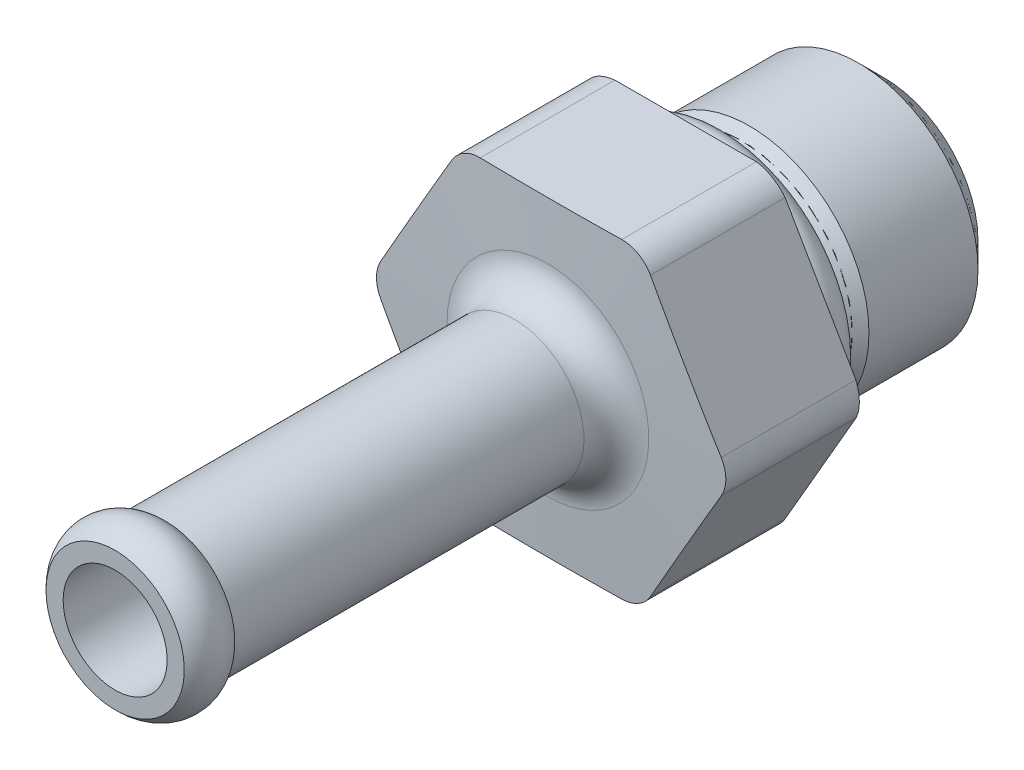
ISO-10303-21;
HEADER;
FILE_DESCRIPTION(('STEP AP214'),'2;1');
FILE_NAME('part.step','',(''),(''),'','','');
FILE_SCHEMA(('AUTOMOTIVE_DESIGN { 1 0 10303 214 1 1 1 1 }'));
ENDSEC;
DATA;
#1=APPLICATION_CONTEXT('core data for automotive mechanical design processes');
#2=APPLICATION_PROTOCOL_DEFINITION('international standard','automotive_design',2000,#1);
#3=PRODUCT_CONTEXT('',#1,'mechanical');
#4=PRODUCT('Part','Part','',(#3));
#5=PRODUCT_RELATED_PRODUCT_CATEGORY('part','',(#4));
#6=PRODUCT_DEFINITION_FORMATION('','',#4);
#7=PRODUCT_DEFINITION_CONTEXT('part definition',#1,'design');
#8=PRODUCT_DEFINITION('design','',#6,#7);
#9=PRODUCT_DEFINITION_SHAPE('','',#8);
#10=(LENGTH_UNIT() NAMED_UNIT(*) SI_UNIT(.MILLI.,.METRE.));
#11=(NAMED_UNIT(*) PLANE_ANGLE_UNIT() SI_UNIT($,.RADIAN.));
#12=(NAMED_UNIT(*) SI_UNIT($,.STERADIAN.) SOLID_ANGLE_UNIT());
#13=UNCERTAINTY_MEASURE_WITH_UNIT(LENGTH_MEASURE(1.E-05),#10,'distance_accuracy_value','');
#14=(GEOMETRIC_REPRESENTATION_CONTEXT(3) GLOBAL_UNCERTAINTY_ASSIGNED_CONTEXT((#13)) GLOBAL_UNIT_ASSIGNED_CONTEXT((#10,
#11,#12)) REPRESENTATION_CONTEXT('',''));
#15=CARTESIAN_POINT('',(0.,0.,0.));
#16=DIRECTION('',(0.,0.,1.));
#17=DIRECTION('',(1.,0.,0.));
#18=AXIS2_PLACEMENT_3D('',#15,#16,#17);
#19=CARTESIAN_POINT('',(0.,0.,0.782320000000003));
#20=DIRECTION('',(0.,0.,0.999999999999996));
#21=DIRECTION('',(1.,0.,0.));
#22=AXIS2_PLACEMENT_3D('',#19,#20,#21);
#23=PLANE('',#22);
#24=CARTESIAN_POINT('',(0.,0.,0.782320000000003));
#25=DIRECTION('',(0.,0.,0.999999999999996));
#26=DIRECTION('',(1.,0.,0.));
#27=AXIS2_PLACEMENT_3D('',#24,#25,#26);
#28=CIRCLE('',#27,5.10032);
#29=CARTESIAN_POINT('',(5.10032000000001,0.,0.782320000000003));
#30=VERTEX_POINT('',#29);
#31=EDGE_CURVE('P0_E24',#30,#30,#28,.T.);
#32=ORIENTED_EDGE('',*,*,#31,.F.);
#33=EDGE_LOOP('',(#32));
#34=FACE_BOUND('',#33,.T.);
#35=ADVANCED_FACE('P0_F16',(#34),#23,.F.);
#36=CARTESIAN_POINT('',(0.,0.,6.56463000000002));
#37=DIRECTION('',(0.,0.,-0.999999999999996));
#38=DIRECTION('',(-1.,0.,0.));
#39=AXIS2_PLACEMENT_3D('',#36,#37,#38);
#40=PLANE('',#39);
#41=CARTESIAN_POINT('',(0.,0.,6.56463000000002));
#42=DIRECTION('',(0.,0.,0.999999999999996));
#43=DIRECTION('',(1.,0.,0.));
#44=AXIS2_PLACEMENT_3D('',#41,#42,#43);
#45=CIRCLE('',#44,5.10032);
#46=CARTESIAN_POINT('',(5.10031999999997,0.,6.56463000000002));
#47=VERTEX_POINT('',#46);
#48=EDGE_CURVE('P0_E11',#47,#47,#45,.F.);
#49=ORIENTED_EDGE('',*,*,#48,.F.);
#50=EDGE_LOOP('',(#49));
#51=FACE_BOUND('',#50,.T.);
#52=ADVANCED_FACE('P0_F32',(#51),#40,.F.);
#53=CARTESIAN_POINT('',(0.,0.,-3.53059999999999));
#54=DIRECTION('',(0.,0.,0.999999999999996));
#55=DIRECTION('',(1.,0.,0.));
#56=AXIS2_PLACEMENT_3D('',#53,#54,#55);
#57=CYLINDRICAL_SURFACE('',#56,5.10032);
#58=ORIENTED_EDGE('',*,*,#48,.T.);
#59=EDGE_LOOP('',(#58));
#60=FACE_BOUND('',#59,.T.);
#61=ORIENTED_EDGE('',*,*,#31,.T.);
#62=EDGE_LOOP('',(#61));
#63=FACE_BOUND('',#62,.T.);
#64=ADVANCED_FACE('P0_F34',(#60,#63),#57,.T.);
#65=CLOSED_SHELL('',(#35,#52,#64));
#66=MANIFOLD_SOLID_BREP('P0_B1',#65);
#67=CARTESIAN_POINT('',(0.,0.,9.1059));
#68=DIRECTION('',(0.,0.,0.999999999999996));
#69=DIRECTION('',(1.,0.,0.));
#70=AXIS2_PLACEMENT_3D('',#67,#68,#69);
#71=PLANE('',#70);
#72=CARTESIAN_POINT('',(0.,0.,9.10590000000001));
#73=DIRECTION('',(0.,0.,0.999999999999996));
#74=DIRECTION('',(-1.,0.,0.));
#75=AXIS2_PLACEMENT_3D('',#72,#73,#74);
#76=CIRCLE('',#75,5.12444999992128);
#77=CARTESIAN_POINT('',(-5.12444999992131,0.,9.10589999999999));
#78=VERTEX_POINT('',#77);
#79=EDGE_CURVE('P1_E55',#78,#78,#76,.T.);
#80=ORIENTED_EDGE('',*,*,#79,.F.);
#81=EDGE_LOOP('',(#80));
#82=FACE_BOUND('',#81,.T.);
#83=CARTESIAN_POINT('',(0.,0.,9.10589999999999));
#84=DIRECTION('',(0.,0.,-0.999999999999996));
#85=DIRECTION('',(1.,0.,0.));
#86=AXIS2_PLACEMENT_3D('',#83,#84,#85);
#87=CIRCLE('',#86,5.3721);
#88=CARTESIAN_POINT('',(5.37209999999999,0.,9.1059));
#89=VERTEX_POINT('',#88);
#90=EDGE_CURVE('P1_E11',#89,#89,#87,.F.);
#91=ORIENTED_EDGE('',*,*,#90,.T.);
#92=EDGE_LOOP('',(#91));
#93=FACE_BOUND('',#92,.T.);
#94=ADVANCED_FACE('P1_F16',(#82,#93),#71,.T.);
#95=CARTESIAN_POINT('',(0.,0.,8.59790000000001));
#96=DIRECTION('',(0.,0.,0.999999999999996));
#97=DIRECTION('',(-0.999999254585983,0.00122099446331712,0.));
#98=AXIS2_PLACEMENT_3D('',#95,#96,#97);
#99=TOROIDAL_SURFACE('',#98,5.12445000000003,0.508);
#100=CARTESIAN_POINT('',(0.,0.,8.73183450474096));
#101=DIRECTION('',(0.,0.,-0.999999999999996));
#102=DIRECTION('',(1.,0.,0.));
#103=AXIS2_PLACEMENT_3D('',#100,#101,#102);
#104=CIRCLE('',#103,4.63442393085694);
#105=CARTESIAN_POINT('',(4.63442393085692,0.,8.73183450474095));
#106=VERTEX_POINT('',#105);
#107=EDGE_CURVE('P1_E25',#106,#106,#104,.T.);
#108=ORIENTED_EDGE('',*,*,#107,.T.);
#109=EDGE_LOOP('',(#108));
#110=FACE_BOUND('',#109,.T.);
#111=ORIENTED_EDGE('',*,*,#79,.T.);
#112=EDGE_LOOP('',(#111));
#113=FACE_BOUND('',#112,.T.);
#114=ADVANCED_FACE('P1_F48',(#110,#113),#99,.T.);
#115=CARTESIAN_POINT('',(0.,0.,8.1915));
#116=DIRECTION('',(0.,0.,-0.999999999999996));
#117=DIRECTION('',(1.,0.,0.));
#118=AXIS2_PLACEMENT_3D('',#115,#116,#117);
#119=TOROIDAL_SURFACE('',#118,5.37209999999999,0.9144);
#120=ORIENTED_EDGE('',*,*,#90,.F.);
#121=EDGE_LOOP('',(#120));
#122=FACE_BOUND('',#121,.T.);
#123=ORIENTED_EDGE('',*,*,#107,.F.);
#124=EDGE_LOOP('',(#123));
#125=FACE_BOUND('',#124,.T.);
#126=ADVANCED_FACE('P1_F29',(#122,#125),#119,.F.);
#127=CLOSED_SHELL('',(#94,#114,#126));
#128=MANIFOLD_SOLID_BREP('P1_B1',#127);
#129=CARTESIAN_POINT('',(0.,0.,9.15224228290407));
#130=DIRECTION('',(0.,0.,0.999999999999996));
#131=DIRECTION('',(1.,0.,0.));
#132=AXIS2_PLACEMENT_3D('',#129,#130,#131);
#133=CONICAL_SURFACE('',#132,8.02155175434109,1.30899693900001);
#134=CARTESIAN_POINT('',(-3.23675639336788,-7.15010000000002,9.10589999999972));
#135=CARTESIAN_POINT('',(-3.23723436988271,-7.15010037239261,9.10595290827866));
#136=CARTESIAN_POINT('',(-3.23771234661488,-7.15010069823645,9.10600581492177));
#137=CARTESIAN_POINT('',(-3.23866833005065,-7.15010125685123,9.10611162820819));
#138=CARTESIAN_POINT('',(-3.23914633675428,-7.1501014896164,9.10616453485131));
#139=CARTESIAN_POINT('',(-3.2401023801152,-7.15010186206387,9.10627034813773));
#140=CARTESIAN_POINT('',(-3.24058041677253,-7.15010200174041,9.10632325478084));
#141=CARTESIAN_POINT('',(-3.24153652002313,-7.15010218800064,9.10642906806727));
#142=CARTESIAN_POINT('',(-3.24201458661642,-7.15010223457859,9.10648197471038));
#143=CARTESIAN_POINT('',(-3.24297074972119,-7.15010223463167,9.10658778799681));
#144=CARTESIAN_POINT('',(-3.2434488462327,-7.15010218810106,9.10664069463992));
#145=CARTESIAN_POINT('',(-3.24440506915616,-7.15010200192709,9.10674650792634));
#146=CARTESIAN_POINT('',(-3.24488319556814,-7.15010186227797,9.10679941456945));
#147=CARTESIAN_POINT('',(-3.24583947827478,-7.15010148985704,9.10690522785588));
#148=CARTESIAN_POINT('',(-3.24631763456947,-7.15010125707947,9.10695813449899));
#149=CARTESIAN_POINT('',(-3.24727397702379,-7.15010069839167,9.10706394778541));
#150=CARTESIAN_POINT('',(-3.24775216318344,-7.1501003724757,9.10711685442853));
#151=CARTESIAN_POINT('',(-3.24823034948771,-7.15009999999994,9.10716975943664));
#152=B_SPLINE_CURVE_WITH_KNOTS('',3,(#134,#135,#136,#137,#138,#139,#140,#141,#142,#143,#144,
#145,#146,#147,#148,#149,#150,#151),.UNSPECIFIED.,.F.,.F.,(4,2,2,2,2,2,2,2,4),(0.,
0.00144268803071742,0.00288546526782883,0.00432833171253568,0.00577128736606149,
0.00721433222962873,0.00865746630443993,0.0101006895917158,0.0115440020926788),.UNSPECIFIED.);
#153=CARTESIAN_POINT('',(-3.2367563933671,-7.1501,9.10589999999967));
#154=VERTEX_POINT('',#153);
#155=CARTESIAN_POINT('',(-3.2482303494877,-7.1501,9.10716975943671));
#156=VERTEX_POINT('',#155);
#157=EDGE_CURVE('P2_E329',#154,#156,#152,.T.);
#158=ORIENTED_EDGE('',*,*,#157,.T.);
#159=CARTESIAN_POINT('',(-4.56805351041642,-6.38809922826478,9.10716966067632));
#160=CARTESIAN_POINT('',(-4.54711794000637,-6.42436069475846,9.11180989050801));
#161=CARTESIAN_POINT('',(-4.52467747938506,-6.45977526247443,9.11610588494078));
#162=CARTESIAN_POINT('',(-4.47691597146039,-6.52868908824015,9.12399296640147));
#163=CARTESIAN_POINT('',(-4.45159488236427,-6.56218831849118,9.12758404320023));
#164=CARTESIAN_POINT('',(-4.37160135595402,-6.65936267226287,9.13726344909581));
#165=CARTESIAN_POINT('',(-4.31282249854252,-6.7198463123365,9.14227473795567));
#166=CARTESIAN_POINT('',(-4.18598339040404,-6.83037843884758,9.14930601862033));
#167=CARTESIAN_POINT('',(-4.11791694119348,-6.88041989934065,9.15132400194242));
#168=CARTESIAN_POINT('',(-3.9744112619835,-6.9686071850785,9.15232670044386));
#169=CARTESIAN_POINT('',(-3.89897019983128,-7.00675004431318,9.15131065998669));
#170=CARTESIAN_POINT('',(-3.74327689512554,-7.06989284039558,9.14627590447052));
#171=CARTESIAN_POINT('',(-3.66304745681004,-7.09495027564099,9.14227051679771));
#172=CARTESIAN_POINT('',(-3.49986287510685,-7.13149735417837,9.13135459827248));
#173=CARTESIAN_POINT('',(-3.41691307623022,-7.14301213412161,9.12444948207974));
#174=CARTESIAN_POINT('',(-3.3052816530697,-7.14930291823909,9.11333232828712));
#175=CARTESIAN_POINT('',(-3.27673953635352,-7.15010561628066,9.11033018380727));
#176=CARTESIAN_POINT('',(-3.24823034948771,-7.15010000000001,9.10716975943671));
#177=B_SPLINE_CURVE_WITH_KNOTS('',3,(#159,#160,#161,#162,#163,#164,#165,#166,#167,#168,#169,
#170,#171,#172,#173,#174,#175,#176),.UNSPECIFIED.,.F.,.F.,(4,2,2,2,2,2,2,2,4),(0.,
0.126307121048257,0.252616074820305,0.504780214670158,0.757113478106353,1.00950959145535,
1.26078712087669,1.51159751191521,1.59767819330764),.UNSPECIFIED.);
#178=CARTESIAN_POINT('',(-4.56805417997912,-6.38809807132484,9.10716951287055));
#179=VERTEX_POINT('',#178);
#180=EDGE_CURVE('P2_E158',#179,#156,#177,.T.);
#181=ORIENTED_EDGE('',*,*,#180,.F.);
#182=CARTESIAN_POINT('',(-4.56805306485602,-6.38809999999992,9.10716975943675));
#183=CARTESIAN_POINT('',(-4.56829248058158,-6.38768606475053,9.10711685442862));
#184=CARTESIAN_POINT('',(-4.56853185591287,-6.38727210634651,9.1070639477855));
#185=CARTESIAN_POINT('',(-4.56901051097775,-6.3864441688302,9.10695813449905));
#186=CARTESIAN_POINT('',(-4.56924979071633,-6.38603018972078,9.10690522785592));
#187=CARTESIAN_POINT('',(-4.56972825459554,-6.38520221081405,9.10679941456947));
#188=CARTESIAN_POINT('',(-4.56996743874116,-6.38478821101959,9.10674650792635));
#189=CARTESIAN_POINT('',(-4.57044571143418,-6.38396019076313,9.10664069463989));
#190=CARTESIAN_POINT('',(-4.57068479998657,-6.38354617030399,9.10658778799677));
#191=CARTESIAN_POINT('',(-4.57116288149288,-6.3827181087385,9.10648197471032));
#192=CARTESIAN_POINT('',(-4.57140187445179,-6.38230406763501,9.1064290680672));
#193=CARTESIAN_POINT('',(-4.5718797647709,-6.38147596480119,9.10632325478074));
#194=CARTESIAN_POINT('',(-4.57211866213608,-6.38106190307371,9.10627034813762));
#195=CARTESIAN_POINT('',(-4.57259636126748,-6.38023375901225,9.10616453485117));
#196=CARTESIAN_POINT('',(-4.57283516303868,-6.37981967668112,9.10611162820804));
#197=CARTESIAN_POINT('',(-4.57331267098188,-6.37899149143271,9.10600581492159));
#198=CARTESIAN_POINT('',(-4.57355137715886,-6.37857738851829,9.10595290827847));
#199=CARTESIAN_POINT('',(-4.57379004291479,-6.37816326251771,9.10589999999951));
#200=B_SPLINE_CURVE_WITH_KNOTS('',3,(#182,#183,#184,#185,#186,#187,#188,#189,#190,#191,#192,
#193,#194,#195,#196,#197,#198,#199),.UNSPECIFIED.,.F.,.F.,(4,2,2,2,2,2,2,2,4),(0.,
0.00144331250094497,0.00288653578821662,0.00432966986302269,0.00577271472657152,
0.00721567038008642,0.00865853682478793,0.0101013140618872,0.0115440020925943),.UNSPECIFIED.);
#201=CARTESIAN_POINT('',(-4.57379004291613,-6.37816326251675,9.10589999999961));
#202=VERTEX_POINT('',#201);
#203=EDGE_CURVE('P2_E167',#179,#202,#200,.T.);
#204=ORIENTED_EDGE('',*,*,#203,.T.);
#205=CARTESIAN_POINT('',(0.,0.,9.10589999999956));
#206=DIRECTION('',(0.,0.,0.999999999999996));
#207=DIRECTION('',(1.,0.,0.));
#208=AXIS2_PLACEMENT_3D('',#205,#206,#207);
#209=CIRCLE('',#208,7.84859999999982);
#210=EDGE_CURVE('P2_E237',#202,#154,#209,.T.);
#211=ORIENTED_EDGE('',*,*,#210,.T.);
#212=EDGE_LOOP('',(#158,#181,#204,#211));
#213=FACE_BOUND('',#212,.T.);
#214=ADVANCED_FACE('P2_F16',(#213),#133,.T.);
#215=CARTESIAN_POINT('',(0.,0.,9.15224228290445));
#216=DIRECTION('',(0.,0.,0.999999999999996));
#217=DIRECTION('',(1.,0.,0.));
#218=AXIS2_PLACEMENT_3D('',#215,#216,#217);
#219=CONICAL_SURFACE('',#218,8.02155175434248,1.308996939);
#220=CARTESIAN_POINT('',(4.57379004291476,-6.37816326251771,9.10589999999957));
#221=CARTESIAN_POINT('',(4.57355137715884,-6.37857738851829,9.10595290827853));
#222=CARTESIAN_POINT('',(4.57331267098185,-6.37899149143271,9.10600581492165));
#223=CARTESIAN_POINT('',(4.57283516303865,-6.37981967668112,9.1061116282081));
#224=CARTESIAN_POINT('',(4.57259636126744,-6.38023375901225,9.10616453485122));
#225=CARTESIAN_POINT('',(4.57211866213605,-6.38106190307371,9.10627034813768));
#226=CARTESIAN_POINT('',(4.57187976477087,-6.38147596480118,9.1063232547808));
#227=CARTESIAN_POINT('',(4.57140187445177,-6.38230406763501,9.10642906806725));
#228=CARTESIAN_POINT('',(4.57116288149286,-6.38271810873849,9.10648197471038));
#229=CARTESIAN_POINT('',(4.57068479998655,-6.38354617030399,9.10658778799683));
#230=CARTESIAN_POINT('',(4.57044571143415,-6.38396019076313,9.10664069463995));
#231=CARTESIAN_POINT('',(4.56996743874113,-6.38478821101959,9.1067465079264));
#232=CARTESIAN_POINT('',(4.56972825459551,-6.38520221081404,9.10679941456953));
#233=CARTESIAN_POINT('',(4.56924979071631,-6.38603018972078,9.10690522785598));
#234=CARTESIAN_POINT('',(4.56901051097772,-6.38644416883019,9.10695813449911));
#235=CARTESIAN_POINT('',(4.56853185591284,-6.3872721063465,9.10706394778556));
#236=CARTESIAN_POINT('',(4.56829248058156,-6.38768606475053,9.10711685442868));
#237=CARTESIAN_POINT('',(4.568053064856,-6.38809999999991,9.10716975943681));
#238=B_SPLINE_CURVE_WITH_KNOTS('',3,(#220,#221,#222,#223,#224,#225,#226,#227,#228,#229,#230,
#231,#232,#233,#234,#235,#236,#237),.UNSPECIFIED.,.F.,.F.,(4,2,2,2,2,2,2,2,4),(0.,
0.0014426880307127,0.00288546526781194,0.00432833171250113,0.00577128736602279,
0.00721433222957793,0.00865746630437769,0.0101006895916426,0.0115440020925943),.UNSPECIFIED.);
#239=CARTESIAN_POINT('',(4.57379004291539,-6.37816326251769,9.10589999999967));
#240=VERTEX_POINT('',#239);
#241=CARTESIAN_POINT('',(4.56805306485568,-6.38809999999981,9.10716975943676));
#242=VERTEX_POINT('',#241);
#243=EDGE_CURVE('P2_E318',#240,#242,#238,.T.);
#244=ORIENTED_EDGE('',*,*,#243,.T.);
#245=CARTESIAN_POINT('',(3.24822945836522,-7.15009999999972,9.10716966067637));
#246=CARTESIAN_POINT('',(3.29010059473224,-7.15009999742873,9.11180989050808));
#247=CARTESIAN_POINT('',(3.33199074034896,-7.14837327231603,9.11610588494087));
#248=CARTESIAN_POINT('',(3.41555261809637,-7.14146750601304,9.12399296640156));
#249=CARTESIAN_POINT('',(3.45722434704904,-7.13628841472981,9.12758404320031));
#250=CARTESIAN_POINT('',(3.58137656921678,-7.11559916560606,9.13726344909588));
#251=CARTESIAN_POINT('',(3.66314636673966,-7.09493700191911,9.14227473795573));
#252=CARTESIAN_POINT('',(3.82228955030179,-7.04035717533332,9.14930601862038));
#253=CARTESIAN_POINT('',(3.89965995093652,-7.00643063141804,9.15132400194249));
#254=CARTESIAN_POINT('',(4.04778522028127,-6.92624471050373,9.15232670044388));
#255=CARTESIAN_POINT('',(4.11853843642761,-6.8799822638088,9.15131065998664));
#256=CARTESIAN_POINT('',(4.25106835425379,-6.77671930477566,9.14627590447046));
#257=CARTESIAN_POINT('',(4.31288344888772,-6.71976729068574,9.1422705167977));
#258=CARTESIAN_POINT('',(4.42612643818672,-6.59671883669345,9.13135459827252));
#259=CARTESIAN_POINT('',(4.47757342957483,-6.53063959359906,9.12444948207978));
#260=CARTESIAN_POINT('',(4.53883712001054,-6.43710933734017,9.11333232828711));
#261=CARTESIAN_POINT('',(4.55380333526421,-6.41279248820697,9.11033018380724));
#262=CARTESIAN_POINT('',(4.5680530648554,-6.38809999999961,9.10716975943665));
#263=B_SPLINE_CURVE_WITH_KNOTS('',3,(#245,#246,#247,#248,#249,#250,#251,#252,#253,#254,#255,
#256,#257,#258,#259,#260,#261,#262),.UNSPECIFIED.,.F.,.F.,(4,2,2,2,2,2,2,2,4),(0.,
0.126307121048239,0.252616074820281,0.504780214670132,0.757113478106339,1.00950959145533,
1.26078712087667,1.51159751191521,1.59767819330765),.UNSPECIFIED.);
#264=CARTESIAN_POINT('',(3.24822812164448,-7.15010000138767,9.10716951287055));
#265=VERTEX_POINT('',#264);
#266=EDGE_CURVE('P2_E650',#265,#242,#263,.T.);
#267=ORIENTED_EDGE('',*,*,#266,.F.);
#268=CARTESIAN_POINT('',(3.24823034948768,-7.15009999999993,9.10716975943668));
#269=CARTESIAN_POINT('',(3.24775216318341,-7.15010037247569,9.10711685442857));
#270=CARTESIAN_POINT('',(3.24727397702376,-7.15010069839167,9.10706394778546));
#271=CARTESIAN_POINT('',(3.24631763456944,-7.15010125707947,9.10695813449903));
#272=CARTESIAN_POINT('',(3.24583947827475,-7.15010148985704,9.10690522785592));
#273=CARTESIAN_POINT('',(3.24488319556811,-7.15010186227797,9.1067994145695));
#274=CARTESIAN_POINT('',(3.24440506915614,-7.15010200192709,9.10674650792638));
#275=CARTESIAN_POINT('',(3.24344884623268,-7.15010218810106,9.10664069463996));
#276=CARTESIAN_POINT('',(3.24297074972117,-7.15010223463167,9.10658778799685));
#277=CARTESIAN_POINT('',(3.24201458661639,-7.15010223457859,9.10648197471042));
#278=CARTESIAN_POINT('',(3.2415365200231,-7.15010218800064,9.10642906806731));
#279=CARTESIAN_POINT('',(3.2405804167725,-7.1501020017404,9.10632325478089));
#280=CARTESIAN_POINT('',(3.24010238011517,-7.15010186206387,9.10627034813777));
#281=CARTESIAN_POINT('',(3.23914633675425,-7.1501014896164,9.10616453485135));
#282=CARTESIAN_POINT('',(3.23866833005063,-7.15010125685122,9.10611162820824));
#283=CARTESIAN_POINT('',(3.23771234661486,-7.15010069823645,9.10600581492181));
#284=CARTESIAN_POINT('',(3.23723436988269,-7.1501003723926,9.1059529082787));
#285=CARTESIAN_POINT('',(3.23675639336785,-7.15010000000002,9.10589999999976));
#286=B_SPLINE_CURVE_WITH_KNOTS('',3,(#268,#269,#270,#271,#272,#273,#274,#275,#276,#277,#278,
#279,#280,#281,#282,#283,#284,#285),.UNSPECIFIED.,.F.,.F.,(4,2,2,2,2,2,2,2,4),(0.,
0.00144331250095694,0.00288653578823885,0.00432966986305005,0.00577271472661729,
0.0072156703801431,0.00865853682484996,0.0101013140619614,0.0115440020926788),.UNSPECIFIED.);
#287=CARTESIAN_POINT('',(3.23675639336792,-7.15010000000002,9.10589999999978));
#288=VERTEX_POINT('',#287);
#289=EDGE_CURVE('P2_E326',#265,#288,#286,.T.);
#290=ORIENTED_EDGE('',*,*,#289,.T.);
#291=CARTESIAN_POINT('',(0.,0.,9.10589999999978));
#292=DIRECTION('',(0.,0.,0.999999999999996));
#293=DIRECTION('',(1.,0.,0.));
#294=AXIS2_PLACEMENT_3D('',#291,#292,#293);
#295=CIRCLE('',#294,7.84860000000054);
#296=EDGE_CURVE('P2_E234',#288,#240,#295,.T.);
#297=ORIENTED_EDGE('',*,*,#296,.T.);
#298=EDGE_LOOP('',(#244,#267,#290,#297));
#299=FACE_BOUND('',#298,.T.);
#300=ADVANCED_FACE('P2_F323',(#299),#219,.T.);
#301=CARTESIAN_POINT('',(0.,0.,9.15222623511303));
#302=DIRECTION('',(0.,0.,0.999999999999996));
#303=DIRECTION('',(1.,0.,0.));
#304=AXIS2_PLACEMENT_3D('',#301,#302,#303);
#305=CONICAL_SURFACE('',#304,8.02149186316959,1.308996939);
#306=CARTESIAN_POINT('',(7.81628341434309,-0.76199999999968,9.10716975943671));
#307=CARTESIAN_POINT('',(7.8372189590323,-0.725738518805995,9.11180998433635));
#308=CARTESIAN_POINT('',(7.85666862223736,-0.688597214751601,9.11610597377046));
#309=CARTESIAN_POINT('',(7.8924689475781,-0.612777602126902,9.12399304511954));
#310=CARTESIAN_POINT('',(7.90881956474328,-0.574099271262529,9.1275841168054));
#311=CARTESIAN_POINT('',(7.95297819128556,-0.456235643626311,9.13726350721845));
#312=CARTESIAN_POINT('',(7.9759690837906,-0.375089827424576,9.142274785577));
#313=CARTESIAN_POINT('',(8.00827306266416,-0.209977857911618,9.14930604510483));
#314=CARTESIAN_POINT('',(8.01757696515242,-0.126009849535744,9.15132401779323));
#315=CARTESIAN_POINT('',(8.02219645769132,0.0423633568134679,9.1523266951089));
#316=CARTESIAN_POINT('',(8.0175085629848,0.126768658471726,9.15131064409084));
#317=CARTESIAN_POINT('',(7.99434508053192,0.293174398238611,9.14627586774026));
#318=CARTESIAN_POINT('',(7.9759306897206,0.375183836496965,9.14227046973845));
#319=CARTESIAN_POINT('',(7.92598900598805,0.534779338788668,9.1313545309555));
#320=CARTESIAN_POINT('',(7.89448615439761,0.612373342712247,9.12444940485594));
#321=CARTESIAN_POINT('',(7.84411849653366,0.712194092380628,9.1133322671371));
#322=CARTESIAN_POINT('',(7.83054272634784,0.737313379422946,9.11033015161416));
#323=CARTESIAN_POINT('',(7.8162834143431,0.761999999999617,9.10716975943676));
#324=B_SPLINE_CURVE_WITH_KNOTS('',3,(#306,#307,#308,#309,#310,#311,#312,#313,#314,#315,#316,
#317,#318,#319,#320,#321,#322,#323),.UNSPECIFIED.,.F.,.F.,(4,2,2,2,2,2,2,2,4),(0.,
0.126307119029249,0.25261607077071,0.504780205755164,0.757113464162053,1.00950957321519,
1.26078710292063,1.51159749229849,1.59767729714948),.UNSPECIFIED.);
#325=CARTESIAN_POINT('',(7.81628341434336,-0.761999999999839,9.10716975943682));
#326=VERTEX_POINT('',#325);
#327=CARTESIAN_POINT('',(7.81628341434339,0.761999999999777,9.10716975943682));
#328=VERTEX_POINT('',#327);
#329=EDGE_CURVE('P2_E641',#326,#328,#324,.T.);
#330=ORIENTED_EDGE('',*,*,#329,.F.);
#331=CARTESIAN_POINT('',(7.81628341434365,-0.761999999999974,9.10716975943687));
#332=CARTESIAN_POINT('',(7.81604464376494,-0.762414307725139,9.10711685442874));
#333=CARTESIAN_POINT('',(7.81580583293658,-0.762828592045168,9.10706394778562));
#334=CARTESIAN_POINT('',(7.81532814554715,-0.763657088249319,9.10695813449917));
#335=CARTESIAN_POINT('',(7.81508926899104,-0.764071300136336,9.10690522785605));
#336=CARTESIAN_POINT('',(7.81461145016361,-0.764899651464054,9.1067994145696));
#337=CARTESIAN_POINT('',(7.81437250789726,-0.76531379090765,9.10674650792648));
#338=CARTESIAN_POINT('',(7.81389455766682,-0.766141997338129,9.10664069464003));
#339=CARTESIAN_POINT('',(7.81365554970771,-0.766556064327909,9.1065877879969));
#340=CARTESIAN_POINT('',(7.81317746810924,-0.767384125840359,9.10648197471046));
#341=CARTESIAN_POINT('',(7.81293839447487,-0.767798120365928,9.10642906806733));
#342=CARTESIAN_POINT('',(7.81246018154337,-0.768626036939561,9.10632325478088));
#343=CARTESIAN_POINT('',(7.81222104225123,-0.769039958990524,9.10627034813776));
#344=CARTESIAN_POINT('',(7.8117426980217,-0.769867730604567,9.10616453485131));
#345=CARTESIAN_POINT('',(7.81150349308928,-0.770281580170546,9.10611162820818));
#346=CARTESIAN_POINT('',(7.81102501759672,-0.771109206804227,9.10600581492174));
#347=CARTESIAN_POINT('',(7.81078574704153,-0.771522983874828,9.10595290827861));
#348=CARTESIAN_POINT('',(7.81054643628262,-0.771936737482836,9.10589999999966));
#349=B_SPLINE_CURVE_WITH_KNOTS('',3,(#331,#332,#333,#334,#335,#336,#337,#338,#339,#340,#341,
#342,#343,#344,#345,#346,#347,#348),.UNSPECIFIED.,.F.,.F.,(4,2,2,2,2,2,2,2,4),(0.,
0.00144331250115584,0.00288653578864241,0.00432966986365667,0.00577271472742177,
0.00721567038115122,0.00865853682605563,0.0101013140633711,0.0115440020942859),.UNSPECIFIED.);
#350=CARTESIAN_POINT('',(7.81054643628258,-0.771936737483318,9.10589999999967));
#351=VERTEX_POINT('',#350);
#352=EDGE_CURVE('P2_E292',#326,#351,#349,.T.);
#353=ORIENTED_EDGE('',*,*,#352,.T.);
#354=CARTESIAN_POINT('',(0.,0.,9.10589999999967));
#355=DIRECTION('',(0.,0.,0.999999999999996));
#356=DIRECTION('',(1.,0.,0.));
#357=AXIS2_PLACEMENT_3D('',#354,#355,#356);
#358=CIRCLE('',#357,7.84860000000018);
#359=CARTESIAN_POINT('',(7.81054643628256,0.771936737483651,9.10589999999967));
#360=VERTEX_POINT('',#359);
#361=EDGE_CURVE('P2_E231',#351,#360,#358,.T.);
#362=ORIENTED_EDGE('',*,*,#361,.T.);
#363=CARTESIAN_POINT('',(7.81054643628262,0.771936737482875,9.10589999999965));
#364=CARTESIAN_POINT('',(7.81078574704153,0.771522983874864,9.10595290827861));
#365=CARTESIAN_POINT('',(7.81102501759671,0.77110920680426,9.10600581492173));
#366=CARTESIAN_POINT('',(7.81150349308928,0.770281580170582,9.10611162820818));
#367=CARTESIAN_POINT('',(7.8117426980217,0.769867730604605,9.1061645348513));
#368=CARTESIAN_POINT('',(7.81222104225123,0.769039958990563,9.10627034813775));
#369=CARTESIAN_POINT('',(7.81246018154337,0.768626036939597,9.10632325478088));
#370=CARTESIAN_POINT('',(7.81293839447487,0.767798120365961,9.10642906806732));
#371=CARTESIAN_POINT('',(7.81317746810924,0.767384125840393,9.10648197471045));
#372=CARTESIAN_POINT('',(7.81365554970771,0.766556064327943,9.1065877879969));
#373=CARTESIAN_POINT('',(7.81389455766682,0.766141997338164,9.10664069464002));
#374=CARTESIAN_POINT('',(7.81437250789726,0.765313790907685,9.10674650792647));
#375=CARTESIAN_POINT('',(7.81461145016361,0.764899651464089,9.1067994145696));
#376=CARTESIAN_POINT('',(7.81508926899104,0.764071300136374,9.10690522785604));
#377=CARTESIAN_POINT('',(7.81532814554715,0.76365708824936,9.10695813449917));
#378=CARTESIAN_POINT('',(7.81580583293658,0.76282859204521,9.10706394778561));
#379=CARTESIAN_POINT('',(7.81604464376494,0.762414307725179,9.10711685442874));
#380=CARTESIAN_POINT('',(7.81628341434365,0.762000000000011,9.10716975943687));
#381=B_SPLINE_CURVE_WITH_KNOTS('',3,(#363,#364,#365,#366,#367,#368,#369,#370,#371,#372,#373,
#374,#375,#376,#377,#378,#379,#380),.UNSPECIFIED.,.F.,.F.,(4,2,2,2,2,2,2,2,4),(0.,
0.00144268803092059,0.00288546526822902,0.00432833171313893,0.00577128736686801,
0.00721433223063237,0.00865746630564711,0.0101006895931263,0.0115440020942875),.UNSPECIFIED.);
#382=EDGE_CURVE('P2_E300',#360,#328,#381,.T.);
#383=ORIENTED_EDGE('',*,*,#382,.T.);
#384=EDGE_LOOP('',(#330,#353,#362,#383));
#385=FACE_BOUND('',#384,.T.);
#386=ADVANCED_FACE('P2_F305',(#385),#305,.T.);
#387=CARTESIAN_POINT('',(0.,0.,9.15224228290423));
#388=DIRECTION('',(0.,0.,0.999999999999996));
#389=DIRECTION('',(1.,0.,0.));
#390=AXIS2_PLACEMENT_3D('',#387,#388,#389);
#391=CONICAL_SURFACE('',#390,8.02155175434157,1.308996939);
#392=CARTESIAN_POINT('',(3.23675639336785,7.15010000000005,9.10589999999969));
#393=CARTESIAN_POINT('',(3.23723436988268,7.15010037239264,9.10595290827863));
#394=CARTESIAN_POINT('',(3.23771234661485,7.15010069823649,9.10600581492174));
#395=CARTESIAN_POINT('',(3.23866833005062,7.15010125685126,9.10611162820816));
#396=CARTESIAN_POINT('',(3.23914633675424,7.15010148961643,9.10616453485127));
#397=CARTESIAN_POINT('',(3.24010238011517,7.1501018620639,9.1062703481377));
#398=CARTESIAN_POINT('',(3.2405804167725,7.15010200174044,9.10632325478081));
#399=CARTESIAN_POINT('',(3.2415365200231,7.15010218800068,9.10642906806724));
#400=CARTESIAN_POINT('',(3.24201458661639,7.15010223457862,9.10648197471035));
#401=CARTESIAN_POINT('',(3.24297074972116,7.15010223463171,9.10658778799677));
#402=CARTESIAN_POINT('',(3.24344884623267,7.1501021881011,9.10664069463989));
#403=CARTESIAN_POINT('',(3.24440506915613,7.15010200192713,9.10674650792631));
#404=CARTESIAN_POINT('',(3.24488319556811,7.15010186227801,9.10679941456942));
#405=CARTESIAN_POINT('',(3.24583947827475,7.15010148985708,9.10690522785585));
#406=CARTESIAN_POINT('',(3.24631763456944,7.1501012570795,9.10695813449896));
#407=CARTESIAN_POINT('',(3.24727397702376,7.15010069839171,9.10706394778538));
#408=CARTESIAN_POINT('',(3.2477521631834,7.15010037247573,9.1071168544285));
#409=CARTESIAN_POINT('',(3.24823034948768,7.15009999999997,9.10716975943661));
#410=B_SPLINE_CURVE_WITH_KNOTS('',3,(#392,#393,#394,#395,#396,#397,#398,#399,#400,#401,#402,
#403,#404,#405,#406,#407,#408,#409),.UNSPECIFIED.,.F.,.F.,(4,2,2,2,2,2,2,2,4),(0.,
0.00144268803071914,0.0028854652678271,0.00432833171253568,0.00577128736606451,
0.00721433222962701,0.00865746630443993,0.0101006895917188,0.0115440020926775),.UNSPECIFIED.);
#411=CARTESIAN_POINT('',(3.23675639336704,7.15010000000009,9.10589999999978));
#412=VERTEX_POINT('',#411);
#413=CARTESIAN_POINT('',(3.24823034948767,7.15010000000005,9.10716975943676));
#414=VERTEX_POINT('',#413);
#415=EDGE_CURVE('P2_E281',#412,#414,#410,.T.);
#416=ORIENTED_EDGE('',*,*,#415,.T.);
#417=CARTESIAN_POINT('',(4.56805351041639,6.38809922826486,9.10716966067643));
#418=CARTESIAN_POINT('',(4.54711794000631,6.42436069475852,9.11180989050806));
#419=CARTESIAN_POINT('',(4.524677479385,6.45977526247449,9.1161058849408));
#420=CARTESIAN_POINT('',(4.47691597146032,6.5286890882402,9.12399296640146));
#421=CARTESIAN_POINT('',(4.4515948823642,6.56218831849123,9.12758404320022));
#422=CARTESIAN_POINT('',(4.37160135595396,6.65936267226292,9.13726344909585));
#423=CARTESIAN_POINT('',(4.31282249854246,6.71984631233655,9.14227473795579));
#424=CARTESIAN_POINT('',(4.18598339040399,6.83037843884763,9.14930601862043));
#425=CARTESIAN_POINT('',(4.11791694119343,6.8804198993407,9.15132400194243));
#426=CARTESIAN_POINT('',(3.97441126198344,6.96860718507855,9.15232670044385));
#427=CARTESIAN_POINT('',(3.89897019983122,7.00675004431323,9.15131065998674));
#428=CARTESIAN_POINT('',(3.74327689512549,7.06989284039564,9.14627590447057));
#429=CARTESIAN_POINT('',(3.66304745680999,7.09495027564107,9.14227051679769));
#430=CARTESIAN_POINT('',(3.49986287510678,7.13149735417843,9.1313545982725));
#431=CARTESIAN_POINT('',(3.41691307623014,7.14301213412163,9.12444948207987));
#432=CARTESIAN_POINT('',(3.30528165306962,7.14930291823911,9.11333232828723));
#433=CARTESIAN_POINT('',(3.27673953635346,7.15010561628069,9.11033018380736));
#434=CARTESIAN_POINT('',(3.24823034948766,7.15010000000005,9.10716975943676));
#435=B_SPLINE_CURVE_WITH_KNOTS('',3,(#417,#418,#419,#420,#421,#422,#423,#424,#425,#426,#427,
#428,#429,#430,#431,#432,#433,#434),.UNSPECIFIED.,.F.,.F.,(4,2,2,2,2,2,2,2,4),(0.,
0.126307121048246,0.25261607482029,0.504780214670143,0.757113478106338,1.00950959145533,
1.26078712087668,1.51159751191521,1.59767819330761),.UNSPECIFIED.);
#436=CARTESIAN_POINT('',(4.56805417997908,6.38809807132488,9.10716951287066));
#437=VERTEX_POINT('',#436);
#438=EDGE_CURVE('P2_E615',#437,#414,#435,.T.);
#439=ORIENTED_EDGE('',*,*,#438,.F.);
#440=CARTESIAN_POINT('',(4.56805306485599,6.38809999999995,9.10716975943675));
#441=CARTESIAN_POINT('',(4.56829248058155,6.38768606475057,9.10711685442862));
#442=CARTESIAN_POINT('',(4.56853185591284,6.38727210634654,9.10706394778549));
#443=CARTESIAN_POINT('',(4.56901051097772,6.38644416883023,9.10695813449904));
#444=CARTESIAN_POINT('',(4.5692497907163,6.38603018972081,9.10690522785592));
#445=CARTESIAN_POINT('',(4.56972825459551,6.38520221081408,9.10679941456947));
#446=CARTESIAN_POINT('',(4.56996743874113,6.38478821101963,9.10674650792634));
#447=CARTESIAN_POINT('',(4.57044571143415,6.38396019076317,9.10664069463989));
#448=CARTESIAN_POINT('',(4.57068479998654,6.38354617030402,9.10658778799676));
#449=CARTESIAN_POINT('',(4.57116288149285,6.38271810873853,9.10648197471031));
#450=CARTESIAN_POINT('',(4.57140187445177,6.38230406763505,9.10642906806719));
#451=CARTESIAN_POINT('',(4.57187976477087,6.38147596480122,9.10632325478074));
#452=CARTESIAN_POINT('',(4.57211866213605,6.38106190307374,9.10627034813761));
#453=CARTESIAN_POINT('',(4.57259636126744,6.38023375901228,9.10616453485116));
#454=CARTESIAN_POINT('',(4.57283516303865,6.37981967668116,9.10611162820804));
#455=CARTESIAN_POINT('',(4.57331267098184,6.37899149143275,9.10600581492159));
#456=CARTESIAN_POINT('',(4.57355137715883,6.37857738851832,9.10595290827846));
#457=CARTESIAN_POINT('',(4.57379004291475,6.37816326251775,9.10589999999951));
#458=B_SPLINE_CURVE_WITH_KNOTS('',3,(#440,#441,#442,#443,#444,#445,#446,#447,#448,#449,#450,
#451,#452,#453,#454,#455,#456,#457),.UNSPECIFIED.,.F.,.F.,(4,2,2,2,2,2,2,2,4),(0.,
0.00144331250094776,0.00288653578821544,0.00432966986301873,0.00577271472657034,
0.00721567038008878,0.00865853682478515,0.0101013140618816,0.0115440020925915),.UNSPECIFIED.);
#459=CARTESIAN_POINT('',(4.5737900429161,6.37816326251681,9.10589999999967));
#460=VERTEX_POINT('',#459);
#461=EDGE_CURVE('P2_E284',#437,#460,#458,.T.);
#462=ORIENTED_EDGE('',*,*,#461,.T.);
#463=CARTESIAN_POINT('',(0.,0.,9.10589999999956));
#464=DIRECTION('',(0.,0.,0.999999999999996));
#465=DIRECTION('',(1.,0.,0.));
#466=AXIS2_PLACEMENT_3D('',#463,#464,#465);
#467=CIRCLE('',#466,7.84859999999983);
#468=EDGE_CURVE('P2_E228',#460,#412,#467,.T.);
#469=ORIENTED_EDGE('',*,*,#468,.T.);
#470=EDGE_LOOP('',(#416,#439,#462,#469));
#471=FACE_BOUND('',#470,.T.);
#472=ADVANCED_FACE('P2_F264',(#471),#391,.T.);
#473=CARTESIAN_POINT('',(0.,0.,9.1522422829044));
#474=DIRECTION('',(0.,0.,0.999999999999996));
#475=DIRECTION('',(0.,-1.,0.));
#476=AXIS2_PLACEMENT_3D('',#473,#474,#475);
#477=CONICAL_SURFACE('',#476,8.02155175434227,1.308996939);
#478=CARTESIAN_POINT('',(-3.24823034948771,7.15009999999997,9.10716975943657));
#479=CARTESIAN_POINT('',(-3.24775216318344,7.15010037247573,9.10711685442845));
#480=CARTESIAN_POINT('',(-3.24727397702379,7.15010069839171,9.10706394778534));
#481=CARTESIAN_POINT('',(-3.24631763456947,7.1501012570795,9.10695813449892));
#482=CARTESIAN_POINT('',(-3.24583947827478,7.15010148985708,9.10690522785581));
#483=CARTESIAN_POINT('',(-3.24488319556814,7.15010186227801,9.10679941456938));
#484=CARTESIAN_POINT('',(-3.24440506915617,7.15010200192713,9.10674650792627));
#485=CARTESIAN_POINT('',(-3.24344884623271,7.1501021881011,9.10664069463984));
#486=CARTESIAN_POINT('',(-3.2429707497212,7.1501022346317,9.10658778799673));
#487=CARTESIAN_POINT('',(-3.24201458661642,7.15010223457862,9.10648197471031));
#488=CARTESIAN_POINT('',(-3.24153652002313,7.15010218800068,9.10642906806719));
#489=CARTESIAN_POINT('',(-3.24058041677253,7.15010200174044,9.10632325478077));
#490=CARTESIAN_POINT('',(-3.24010238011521,7.1501018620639,9.10627034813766));
#491=CARTESIAN_POINT('',(-3.23914633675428,7.15010148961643,9.10616453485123));
#492=CARTESIAN_POINT('',(-3.23866833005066,7.15010125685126,9.10611162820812));
#493=CARTESIAN_POINT('',(-3.23771234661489,7.15010069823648,9.1060058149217));
#494=CARTESIAN_POINT('',(-3.23723436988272,7.15010037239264,9.10595290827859));
#495=CARTESIAN_POINT('',(-3.23675639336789,7.15010000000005,9.10589999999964));
#496=B_SPLINE_CURVE_WITH_KNOTS('',3,(#478,#479,#480,#481,#482,#483,#484,#485,#486,#487,#488,
#489,#490,#491,#492,#493,#494,#495),.UNSPECIFIED.,.F.,.F.,(4,2,2,2,2,2,2,2,4),(0.,
0.00144331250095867,0.00288653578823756,0.00432966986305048,0.00577271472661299,
0.00721567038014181,0.00865853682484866,0.0101013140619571,0.0115440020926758),.UNSPECIFIED.);
#497=CARTESIAN_POINT('',(-3.24823034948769,7.1501,9.10716975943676));
#498=VERTEX_POINT('',#497);
#499=CARTESIAN_POINT('',(-3.23675639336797,7.15010000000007,9.10589999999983));
#500=VERTEX_POINT('',#499);
#501=EDGE_CURVE('P2_E278',#498,#500,#496,.T.);
#502=ORIENTED_EDGE('',*,*,#501,.T.);
#503=CARTESIAN_POINT('',(0.,0.,9.10589999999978));
#504=DIRECTION('',(0.,0.,0.999999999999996));
#505=DIRECTION('',(0.,-1.,0.));
#506=AXIS2_PLACEMENT_3D('',#503,#504,#505);
#507=CIRCLE('',#506,7.84860000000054);
#508=CARTESIAN_POINT('',(-4.57379004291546,6.37816326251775,9.10589999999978));
#509=VERTEX_POINT('',#508);
#510=EDGE_CURVE('P2_E225',#500,#509,#507,.T.);
#511=ORIENTED_EDGE('',*,*,#510,.T.);
#512=CARTESIAN_POINT('',(-4.57379004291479,6.37816326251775,9.10589999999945));
#513=CARTESIAN_POINT('',(-4.57355137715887,6.37857738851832,9.1059529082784));
#514=CARTESIAN_POINT('',(-4.57331267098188,6.37899149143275,9.10600581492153));
#515=CARTESIAN_POINT('',(-4.57283516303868,6.37981967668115,9.10611162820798));
#516=CARTESIAN_POINT('',(-4.57259636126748,6.38023375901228,9.1061645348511));
#517=CARTESIAN_POINT('',(-4.57211866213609,6.38106190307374,9.10627034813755));
#518=CARTESIAN_POINT('',(-4.5718797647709,6.38147596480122,9.10632325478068));
#519=CARTESIAN_POINT('',(-4.5714018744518,6.38230406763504,9.10642906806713));
#520=CARTESIAN_POINT('',(-4.57116288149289,6.38271810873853,9.10648197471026));
#521=CARTESIAN_POINT('',(-4.57068479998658,6.38354617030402,9.10658778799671));
#522=CARTESIAN_POINT('',(-4.57044571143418,6.38396019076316,9.10664069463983));
#523=CARTESIAN_POINT('',(-4.56996743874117,6.38478821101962,9.10674650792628));
#524=CARTESIAN_POINT('',(-4.56972825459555,6.38520221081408,9.10679941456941));
#525=CARTESIAN_POINT('',(-4.56924979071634,6.38603018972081,9.10690522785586));
#526=CARTESIAN_POINT('',(-4.56901051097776,6.38644416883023,9.10695813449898));
#527=CARTESIAN_POINT('',(-4.56853185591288,6.38727210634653,9.10706394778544));
#528=CARTESIAN_POINT('',(-4.56829248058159,6.38768606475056,9.10711685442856));
#529=CARTESIAN_POINT('',(-4.56805306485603,6.38809999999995,9.10716975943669));
#530=B_SPLINE_CURVE_WITH_KNOTS('',3,(#512,#513,#514,#515,#516,#517,#518,#519,#520,#521,#522,
#523,#524,#525,#526,#527,#528,#529),.UNSPECIFIED.,.F.,.F.,(4,2,2,2,2,2,2,2,4),(0.,
0.00144268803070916,0.00288546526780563,0.00432833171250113,0.00577128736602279,
0.00721433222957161,0.00865746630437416,0.0101006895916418,0.0115440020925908),.UNSPECIFIED.);
#531=CARTESIAN_POINT('',(-4.56805306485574,6.38809999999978,9.10716975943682));
#532=VERTEX_POINT('',#531);
#533=EDGE_CURVE('P2_E283',#509,#532,#530,.T.);
#534=ORIENTED_EDGE('',*,*,#533,.T.);
#535=CARTESIAN_POINT('',(-3.24823034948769,7.1501,9.10716975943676));
#536=CARTESIAN_POINT('',(-3.29010148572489,7.15009997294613,9.11180998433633));
#537=CARTESIAN_POINT('',(-3.33199163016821,7.1483732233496,9.11610597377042));
#538=CARTESIAN_POINT('',(-3.41555350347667,7.14146740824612,9.12399304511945));
#539=CARTESIAN_POINT('',(-3.45722522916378,7.13628829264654,9.12758411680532));
#540=CARTESIAN_POINT('',(-3.58137743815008,7.11559897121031,9.13726350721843));
#541=CARTESIAN_POINT('',(-3.66314722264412,7.09493676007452,9.14227478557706));
#542=CARTESIAN_POINT('',(-3.82229037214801,7.0403568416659,9.14930604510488));
#543=CARTESIAN_POINT('',(-3.89966075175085,7.00643025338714,9.15132401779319));
#544=CARTESIAN_POINT('',(-4.04778597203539,6.92624424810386,9.15232669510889));
#545=CARTESIAN_POINT('',(-4.1185391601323,6.87998176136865,9.15131064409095));
#546=CARTESIAN_POINT('',(-4.25106901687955,6.77671872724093,9.14627586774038));
#547=CARTESIAN_POINT('',(-4.31288407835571,6.71976667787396,9.14227046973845));
#548=CARTESIAN_POINT('',(-4.42612699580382,6.59671815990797,9.13135453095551));
#549=CARTESIAN_POINT('',(-4.47757394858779,6.53063888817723,9.12444940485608));
#550=CARTESIAN_POINT('',(-4.5388374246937,6.43710884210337,9.11333226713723));
#551=CARTESIAN_POINT('',(-4.55380348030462,6.41279223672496,9.11033015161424));
#552=CARTESIAN_POINT('',(-4.56805306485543,6.38809999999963,9.10716975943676));
#553=B_SPLINE_CURVE_WITH_KNOTS('',3,(#535,#536,#537,#538,#539,#540,#541,#542,#543,#544,#545,
#546,#547,#548,#549,#550,#551,#552),.UNSPECIFIED.,.F.,.F.,(4,2,2,2,2,2,2,2,4),(0.,
0.126307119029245,0.252616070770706,0.504780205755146,0.757113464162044,1.0095095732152,
1.26078710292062,1.51159749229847,1.59767729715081),.UNSPECIFIED.);
#554=EDGE_CURVE('P2_E243',#498,#532,#553,.T.);
#555=ORIENTED_EDGE('',*,*,#554,.F.);
#556=EDGE_LOOP('',(#502,#511,#534,#555));
#557=FACE_BOUND('',#556,.T.);
#558=ADVANCED_FACE('P2_F258',(#557),#477,.T.);
#559=CARTESIAN_POINT('',(0.,0.,9.15222766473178));
#560=DIRECTION('',(0.,0.,0.999999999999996));
#561=DIRECTION('',(0.,-1.,0.));
#562=AXIS2_PLACEMENT_3D('',#559,#560,#561);
#563=CONICAL_SURFACE('',#562,8.02149719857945,1.308996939);
#564=CARTESIAN_POINT('',(0.,0.,9.10589999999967));
#565=DIRECTION('',(0.,0.,0.999999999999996));
#566=DIRECTION('',(0.,-1.,0.));
#567=AXIS2_PLACEMENT_3D('',#564,#565,#566);
#568=CIRCLE('',#567,7.84860000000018);
#569=CARTESIAN_POINT('',(-7.81054643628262,0.771936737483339,9.10589999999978));
#570=VERTEX_POINT('',#569);
#571=CARTESIAN_POINT('',(-7.81054643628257,-0.771936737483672,9.10589999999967));
#572=VERTEX_POINT('',#571);
#573=EDGE_CURVE('P2_E240',#570,#572,#568,.T.);
#574=ORIENTED_EDGE('',*,*,#573,.T.);
#575=CARTESIAN_POINT('',(-7.81054643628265,-0.77193673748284,9.10589999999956));
#576=CARTESIAN_POINT('',(-7.81078574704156,-0.771522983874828,9.10595290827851));
#577=CARTESIAN_POINT('',(-7.81102501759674,-0.771109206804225,9.10600581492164));
#578=CARTESIAN_POINT('',(-7.81150349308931,-0.770281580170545,9.10611162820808));
#579=CARTESIAN_POINT('',(-7.81174269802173,-0.769867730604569,9.10616453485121));
#580=CARTESIAN_POINT('',(-7.81222104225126,-0.769039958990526,9.10627034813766));
#581=CARTESIAN_POINT('',(-7.8124601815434,-0.76862603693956,9.10632325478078));
#582=CARTESIAN_POINT('',(-7.8129383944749,-0.767798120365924,9.10642906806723));
#583=CARTESIAN_POINT('',(-7.81317746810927,-0.767384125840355,9.10648197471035));
#584=CARTESIAN_POINT('',(-7.81365554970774,-0.766556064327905,9.1065877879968));
#585=CARTESIAN_POINT('',(-7.81389455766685,-0.766141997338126,9.10664069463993));
#586=CARTESIAN_POINT('',(-7.81437250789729,-0.765313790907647,9.10674650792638));
#587=CARTESIAN_POINT('',(-7.81461145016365,-0.76489965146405,9.1067994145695));
#588=CARTESIAN_POINT('',(-7.81508926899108,-0.764071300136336,9.10690522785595));
#589=CARTESIAN_POINT('',(-7.81532814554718,-0.763657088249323,9.10695813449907));
#590=CARTESIAN_POINT('',(-7.81580583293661,-0.762828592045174,9.10706394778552));
#591=CARTESIAN_POINT('',(-7.81604464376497,-0.762414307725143,9.10711685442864));
#592=CARTESIAN_POINT('',(-7.81628341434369,-0.761999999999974,9.10716975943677));
#593=B_SPLINE_CURVE_WITH_KNOTS('',3,(#575,#576,#577,#578,#579,#580,#581,#582,#583,#584,#585,
#586,#587,#588,#589,#590,#591,#592),.UNSPECIFIED.,.F.,.F.,(4,2,2,2,2,2,2,2,4),(0.,
0.00144268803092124,0.00288546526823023,0.00432833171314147,0.00577128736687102,
0.00721433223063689,0.00865746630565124,0.010100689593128,0.0115440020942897),.UNSPECIFIED.);
#594=CARTESIAN_POINT('',(-7.81628341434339,-0.761999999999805,9.10716975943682));
#595=VERTEX_POINT('',#594);
#596=EDGE_CURVE('P2_E159',#572,#595,#593,.T.);
#597=ORIENTED_EDGE('',*,*,#596,.T.);
#598=CARTESIAN_POINT('',(-7.81628341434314,0.761999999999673,9.10716975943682));
#599=CARTESIAN_POINT('',(-7.83721895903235,0.725738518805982,9.11180998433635));
#600=CARTESIAN_POINT('',(-7.8566686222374,0.68859721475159,9.11610597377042));
#601=CARTESIAN_POINT('',(-7.89246894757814,0.612777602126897,9.12399304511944));
#602=CARTESIAN_POINT('',(-7.90881956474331,0.574099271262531,9.12758411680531));
#603=CARTESIAN_POINT('',(-7.9529781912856,0.456235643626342,9.13726350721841));
#604=CARTESIAN_POINT('',(-7.97596908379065,0.375089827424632,9.14227478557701));
#605=CARTESIAN_POINT('',(-8.00827306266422,0.209977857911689,9.14930604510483));
#606=CARTESIAN_POINT('',(-8.01757696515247,0.126009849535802,9.15132401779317));
#607=CARTESIAN_POINT('',(-8.02219645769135,-0.0423633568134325,9.15232669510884));
#608=CARTESIAN_POINT('',(-8.01750856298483,-0.126768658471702,9.15131064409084));
#609=CARTESIAN_POINT('',(-7.99434508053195,-0.293174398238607,9.14627586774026));
#610=CARTESIAN_POINT('',(-7.97593068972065,-0.375183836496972,9.14227046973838));
#611=CARTESIAN_POINT('',(-7.9259890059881,-0.534779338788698,9.13135453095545));
#612=CARTESIAN_POINT('',(-7.89448615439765,-0.612373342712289,9.12444940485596));
#613=CARTESIAN_POINT('',(-7.84411849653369,-0.712194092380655,9.11333226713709));
#614=CARTESIAN_POINT('',(-7.83054272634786,-0.737313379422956,9.11033015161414));
#615=CARTESIAN_POINT('',(-7.81628341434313,-0.76199999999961,9.10716975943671));
#616=B_SPLINE_CURVE_WITH_KNOTS('',3,(#598,#599,#600,#601,#602,#603,#604,#605,#606,#607,#608,
#609,#610,#611,#612,#613,#614,#615),.UNSPECIFIED.,.F.,.F.,(4,2,2,2,2,2,2,2,4),(0.,
0.126307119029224,0.25261607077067,0.504780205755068,0.757113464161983,1.00950957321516,
1.26078710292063,1.51159749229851,1.59767729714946),.UNSPECIFIED.);
#617=CARTESIAN_POINT('',(-7.81628341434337,0.761999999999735,9.10716975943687));
#618=VERTEX_POINT('',#617);
#619=EDGE_CURVE('P2_E194',#618,#595,#616,.T.);
#620=ORIENTED_EDGE('',*,*,#619,.F.);
#621=CARTESIAN_POINT('',(-7.81628341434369,0.762000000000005,9.10716975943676));
#622=CARTESIAN_POINT('',(-7.81604464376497,0.762414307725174,9.10711685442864));
#623=CARTESIAN_POINT('',(-7.81580583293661,0.762828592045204,9.10706394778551));
#624=CARTESIAN_POINT('',(-7.81532814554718,0.763657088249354,9.10695813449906));
#625=CARTESIAN_POINT('',(-7.81508926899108,0.764071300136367,9.10690522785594));
#626=CARTESIAN_POINT('',(-7.81461145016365,0.764899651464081,9.10679941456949));
#627=CARTESIAN_POINT('',(-7.81437250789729,0.765313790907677,9.10674650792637));
#628=CARTESIAN_POINT('',(-7.81389455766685,0.766141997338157,9.10664069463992));
#629=CARTESIAN_POINT('',(-7.81365554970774,0.766556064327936,9.1065877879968));
#630=CARTESIAN_POINT('',(-7.81317746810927,0.767384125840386,9.10648197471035));
#631=CARTESIAN_POINT('',(-7.8129383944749,0.767798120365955,9.10642906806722));
#632=CARTESIAN_POINT('',(-7.8124601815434,0.768626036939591,9.10632325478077));
#633=CARTESIAN_POINT('',(-7.81222104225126,0.769039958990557,9.10627034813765));
#634=CARTESIAN_POINT('',(-7.81174269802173,0.7698677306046,9.1061645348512));
#635=CARTESIAN_POINT('',(-7.81150349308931,0.770281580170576,9.10611162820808));
#636=CARTESIAN_POINT('',(-7.81102501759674,0.771109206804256,9.10600581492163));
#637=CARTESIAN_POINT('',(-7.81078574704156,0.771522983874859,9.10595290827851));
#638=CARTESIAN_POINT('',(-7.81054643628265,0.77193673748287,9.10589999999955));
#639=B_SPLINE_CURVE_WITH_KNOTS('',3,(#621,#622,#623,#624,#625,#626,#627,#628,#629,#630,#631,
#632,#633,#634,#635,#636,#637,#638),.UNSPECIFIED.,.F.,.F.,(4,2,2,2,2,2,2,2,4),(0.,
0.00144331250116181,0.00288653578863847,0.00432966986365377,0.00577271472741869,
0.00721567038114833,0.00865853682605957,0.0101013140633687,0.0115440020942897),.UNSPECIFIED.);
#640=EDGE_CURVE('P2_E561',#618,#570,#639,.T.);
#641=ORIENTED_EDGE('',*,*,#640,.T.);
#642=EDGE_LOOP('',(#574,#597,#620,#641));
#643=FACE_BOUND('',#642,.T.);
#644=ADVANCED_FACE('P2_F263',(#643),#563,.T.);
#645=CARTESIAN_POINT('',(0.,0.,8.1915));
#646=DIRECTION('',(0.,0.,-0.999999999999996));
#647=DIRECTION('',(1.,0.,0.));
#648=AXIS2_PLACEMENT_3D('',#645,#646,#647);
#649=TOROIDAL_SURFACE('',#648,5.3721,0.9144);
#650=CARTESIAN_POINT('',(0.,0.,7.67660152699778));
#651=DIRECTION('',(0.,0.,0.999999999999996));
#652=DIRECTION('',(1.,0.,0.));
#653=AXIS2_PLACEMENT_3D('',#650,#651,#652);
#654=CIRCLE('',#653,4.61645);
#655=CARTESIAN_POINT('',(4.61644999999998,0.,7.6766015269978));
#656=VERTEX_POINT('',#655);
#657=EDGE_CURVE('P2_E170',#656,#656,#654,.F.);
#658=ORIENTED_EDGE('',*,*,#657,.F.);
#659=EDGE_LOOP('',(#658));
#660=FACE_BOUND('',#659,.T.);
#661=CARTESIAN_POINT('',(0.,0.,9.10589999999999));
#662=DIRECTION('',(0.,0.,-0.999999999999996));
#663=DIRECTION('',(1.,0.,0.));
#664=AXIS2_PLACEMENT_3D('',#661,#662,#663);
#665=CIRCLE('',#664,5.37210000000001);
#666=CARTESIAN_POINT('',(5.37209999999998,0.,9.1059));
#667=VERTEX_POINT('',#666);
#668=EDGE_CURVE('P2_E33',#667,#667,#665,.T.);
#669=ORIENTED_EDGE('',*,*,#668,.T.);
#670=EDGE_LOOP('',(#669));
#671=FACE_BOUND('',#670,.T.);
#672=ADVANCED_FACE('P2_F448',(#660,#671),#649,.T.);
#673=CARTESIAN_POINT('',(-3.24823034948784,-5.62609999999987,35.3114136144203));
#674=DIRECTION('',(0.,0.,-0.999999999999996));
#675=DIRECTION('',(-1.,0.,0.));
#676=AXIS2_PLACEMENT_3D('',#673,#674,#675);
#677=CYLINDRICAL_SURFACE('',#676,1.524);
#678=DIRECTION('',(0.,0.,0.999999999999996));
#679=VECTOR('',#678,1.);
#680=CARTESIAN_POINT('',(-4.56805306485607,-6.38810000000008,0.));
#681=LINE('',#680,#679);
#682=CARTESIAN_POINT('',(-4.56805306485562,-6.38810000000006,15.2897393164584));
#683=VERTEX_POINT('',#682);
#684=EDGE_CURVE('P2_E151',#179,#683,#681,.T.);
#685=ORIENTED_EDGE('',*,*,#684,.F.);
#686=ORIENTED_EDGE('',*,*,#180,.T.);
#687=DIRECTION('',(0.,0.,-0.999999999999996));
#688=VECTOR('',#687,1.);
#689=CARTESIAN_POINT('',(-3.2482303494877,-7.1501,0.));
#690=LINE('',#689,#688);
#691=CARTESIAN_POINT('',(-3.24823034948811,-7.1500999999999,15.2897393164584));
#692=VERTEX_POINT('',#691);
#693=EDGE_CURVE('P2_E153',#692,#156,#690,.T.);
#694=ORIENTED_EDGE('',*,*,#693,.F.);
#695=CARTESIAN_POINT('',(-3.24823034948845,-7.15009999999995,15.2897393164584));
#696=CARTESIAN_POINT('',(-3.29110285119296,-7.15009951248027,15.2889651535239));
#697=CARTESIAN_POINT('',(-3.333955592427,-7.14828966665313,15.2882504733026));
#698=CARTESIAN_POINT('',(-3.41935622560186,-7.14106879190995,15.2869422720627));
#699=CARTESIAN_POINT('',(-3.46190413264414,-7.13565794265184,15.2863487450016));
#700=CARTESIAN_POINT('',(-3.58847086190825,-7.11408880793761,15.284755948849));
#701=CARTESIAN_POINT('',(-3.67164701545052,-7.09259369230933,15.2839402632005));
#702=CARTESIAN_POINT('',(-3.83323580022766,-7.03595622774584,15.2828146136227));
#703=CARTESIAN_POINT('',(-3.91164451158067,-7.00080281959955,15.282505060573));
#704=CARTESIAN_POINT('',(-4.06151060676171,-6.91779504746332,15.2823973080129));
#705=CARTESIAN_POINT('',(-4.13296635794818,-6.86993771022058,15.2825992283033));
#706=CARTESIAN_POINT('',(-4.23678698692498,-6.78695204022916,15.2833063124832));
#707=CARTESIAN_POINT('',(-4.27233381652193,-6.75571333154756,15.283635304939));
#708=CARTESIAN_POINT('',(-4.34038551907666,-6.69005758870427,15.284446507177));
#709=CARTESIAN_POINT('',(-4.37289000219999,-6.65564014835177,15.2849287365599));
#710=CARTESIAN_POINT('',(-4.43463705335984,-6.58383847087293,15.2860456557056));
#711=CARTESIAN_POINT('',(-4.46387059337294,-6.54644648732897,15.286680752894));
#712=CARTESIAN_POINT('',(-4.51872909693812,-6.46910739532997,15.2880994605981));
#713=CARTESIAN_POINT('',(-4.54435416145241,-6.42916035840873,15.2888830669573));
#714=CARTESIAN_POINT('',(-4.5680530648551,-6.38810000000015,15.2897393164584));
#715=B_SPLINE_CURVE_WITH_KNOTS('',3,(#695,#696,#697,#698,#699,#700,#701,#702,#703,#704,#705,
#706,#707,#708,#709,#710,#711,#712,#713,#714),.UNSPECIFIED.,.F.,.F.,(4,2,2,2,2,2,2,2,2,4),(0.,
0.128558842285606,0.257111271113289,0.513521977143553,0.770140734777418,1.02681960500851,
1.16861658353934,1.31043170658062,1.45262906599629,1.59482244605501),.UNSPECIFIED.);
#716=EDGE_CURVE('P2_E147',#692,#683,#715,.T.);
#717=ORIENTED_EDGE('',*,*,#716,.T.);
#718=EDGE_LOOP('',(#685,#686,#694,#717));
#719=FACE_BOUND('',#718,.T.);
#720=ADVANCED_FACE('P2_F149',(#719),#677,.T.);
#721=CARTESIAN_POINT('',(3.24823034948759,-5.62609999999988,35.3114136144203));
#722=DIRECTION('',(0.,0.,-0.999999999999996));
#723=DIRECTION('',(-1.,0.,0.));
#724=AXIS2_PLACEMENT_3D('',#721,#722,#723);
#725=CYLINDRICAL_SURFACE('',#724,1.524);
#726=DIRECTION('',(0.,0.,-0.999999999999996));
#727=VECTOR('',#726,1.);
#728=CARTESIAN_POINT('',(3.24823034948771,-7.15010000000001,0.));
#729=LINE('',#728,#727);
#730=CARTESIAN_POINT('',(3.248230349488,-7.15009999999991,15.2897393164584));
#731=VERTEX_POINT('',#730);
#732=EDGE_CURVE('P2_E421',#265,#731,#729,.F.);
#733=ORIENTED_EDGE('',*,*,#732,.F.);
#734=ORIENTED_EDGE('',*,*,#266,.T.);
#735=DIRECTION('',(0.,0.,0.999999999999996));
#736=VECTOR('',#735,1.);
#737=CARTESIAN_POINT('',(4.56805306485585,-6.38809999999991,0.));
#738=LINE('',#737,#736);
#739=CARTESIAN_POINT('',(4.56805306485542,-6.38810000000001,15.2897393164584));
#740=VERTEX_POINT('',#739);
#741=EDGE_CURVE('P2_E404',#740,#242,#738,.F.);
#742=ORIENTED_EDGE('',*,*,#741,.F.);
#743=CARTESIAN_POINT('',(4.56805306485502,-6.38810000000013,15.2897393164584));
#744=CARTESIAN_POINT('',(4.54661639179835,-6.4252284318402,15.2889651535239));
#745=CARTESIAN_POINT('',(4.52362264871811,-6.46143507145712,15.2882504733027));
#746=CARTESIAN_POINT('',(4.47466887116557,-6.53178375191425,15.2869422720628));
#747=CARTESIAN_POINT('',(4.44870898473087,-6.56592589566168,15.2863487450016));
#748=CARTESIAN_POINT('',(4.36674620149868,-6.6647513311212,15.2847559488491));
#749=CARTESIAN_POINT('',(4.30654280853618,-6.72603643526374,15.2839402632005));
#750=CARTESIAN_POINT('',(4.17669893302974,-6.8376576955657,15.2828146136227));
#751=CARTESIAN_POINT('',(4.10705083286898,-6.88798492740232,15.282505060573));
#752=CARTESIAN_POINT('',(3.96023094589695,-6.97626888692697,15.2823973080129));
#753=CARTESIAN_POINT('',(3.883057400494,-7.01422271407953,15.2825992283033));
#754=CARTESIAN_POINT('',(3.75927938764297,-7.06264118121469,15.2833063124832));
#755=CARTESIAN_POINT('',(3.71445245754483,-7.07780628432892,15.283635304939));
#756=CARTESIAN_POINT('',(3.62356706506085,-7.10391291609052,15.2844465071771));
#757=CARTESIAN_POINT('',(3.57750844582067,-7.11485390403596,15.2849287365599));
#758=CARTESIAN_POINT('',(3.48445284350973,-7.13242758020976,15.2860456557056));
#759=CARTESIAN_POINT('',(3.43745366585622,-7.1390485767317,15.286680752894));
#760=CARTESIAN_POINT('',(3.34304679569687,-7.14788788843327,15.2880994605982));
#761=CARTESIAN_POINT('',(3.29563911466,-7.15010632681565,15.2888830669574));
#762=CARTESIAN_POINT('',(3.24823034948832,-7.15009999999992,15.2897393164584));
#763=B_SPLINE_CURVE_WITH_KNOTS('',3,(#743,#744,#745,#746,#747,#748,#749,#750,#751,#752,#753,
#754,#755,#756,#757,#758,#759,#760,#761,#762),.UNSPECIFIED.,.F.,.F.,(4,2,2,2,2,2,2,2,2,4),(0.,
0.128558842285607,0.257111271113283,0.513521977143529,0.770140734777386,1.02681960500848,
1.16861658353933,1.31043170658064,1.45262906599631,1.59482244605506),.UNSPECIFIED.);
#764=EDGE_CURVE('P2_E399',#740,#731,#763,.T.);
#765=ORIENTED_EDGE('',*,*,#764,.T.);
#766=EDGE_LOOP('',(#733,#734,#742,#765));
#767=FACE_BOUND('',#766,.T.);
#768=ADVANCED_FACE('P2_F456',(#767),#725,.T.);
#769=CARTESIAN_POINT('',(6.49646069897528,1.31838984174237E-13,35.3114136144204));
#770=DIRECTION('',(0.,0.,-0.999999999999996));
#771=DIRECTION('',(-1.,0.,0.));
#772=AXIS2_PLACEMENT_3D('',#769,#770,#771);
#773=CYLINDRICAL_SURFACE('',#772,1.524);
#774=DIRECTION('',(0.,0.,0.999999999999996));
#775=VECTOR('',#774,1.);
#776=CARTESIAN_POINT('',(7.81628341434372,-0.762000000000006,0.));
#777=LINE('',#776,#775);
#778=CARTESIAN_POINT('',(7.81628341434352,-0.761999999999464,15.2897393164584));
#779=VERTEX_POINT('',#778);
#780=EDGE_CURVE('P2_E406',#326,#779,#777,.T.);
#781=ORIENTED_EDGE('',*,*,#780,.F.);
#782=ORIENTED_EDGE('',*,*,#329,.T.);
#783=DIRECTION('',(0.,0.,0.999999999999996));
#784=VECTOR('',#783,1.);
#785=CARTESIAN_POINT('',(7.81628341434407,0.761999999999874,0.));
#786=LINE('',#785,#784);
#787=CARTESIAN_POINT('',(7.81628341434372,0.761999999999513,15.2897393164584));
#788=VERTEX_POINT('',#787);
#789=EDGE_CURVE('P2_E411',#788,#328,#786,.F.);
#790=ORIENTED_EDGE('',*,*,#789,.F.);
#791=CARTESIAN_POINT('',(7.81628341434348,0.761999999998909,15.2897393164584));
#792=CARTESIAN_POINT('',(7.83774962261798,0.72481535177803,15.2889640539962));
#793=CARTESIAN_POINT('',(7.85763368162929,0.686746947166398,15.2882484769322));
#794=CARTESIAN_POINT('',(7.8941281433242,0.609055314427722,15.2869385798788));
#795=CARTESIAN_POINT('',(7.91073749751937,0.56943159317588,15.2863442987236));
#796=CARTESIAN_POINT('',(7.95529087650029,0.449067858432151,15.2847533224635));
#797=CARTESIAN_POINT('',(7.97822104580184,0.366382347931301,15.2839391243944));
#798=CARTESIAN_POINT('',(8.00283558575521,0.235931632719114,15.2830663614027));
#799=CARTESIAN_POINT('',(8.00943403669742,0.189021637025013,15.2828327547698));
#800=CARTESIAN_POINT('',(8.01824908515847,0.0947481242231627,15.2825208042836));
#801=CARTESIAN_POINT('',(8.02046220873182,0.0473842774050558,15.2824425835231));
#802=CARTESIAN_POINT('',(8.02045797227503,-0.0855785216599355,15.2824426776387));
#803=CARTESIAN_POINT('',(8.01323149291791,-0.171223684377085,15.282697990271));
#804=CARTESIAN_POINT('',(7.98448868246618,-0.340135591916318,15.2837167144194));
#805=CARTESIAN_POINT('',(7.96296327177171,-0.423400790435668,15.2844804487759));
#806=CARTESIAN_POINT('',(7.91894938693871,-0.548959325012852,15.2860506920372));
#807=CARTESIAN_POINT('',(7.90117536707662,-0.592958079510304,15.2866860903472));
#808=CARTESIAN_POINT('',(7.86166203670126,-0.678996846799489,15.2881035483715));
#809=CARTESIAN_POINT('',(7.83993312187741,-0.721041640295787,15.2888852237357));
#810=CARTESIAN_POINT('',(7.81628341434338,-0.761999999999,15.2897393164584));
#811=B_SPLINE_CURVE_WITH_KNOTS('',3,(#791,#792,#793,#794,#795,#796,#797,#798,#799,#800,#801,
#802,#803,#804,#805,#806,#807,#808,#809,#810),.UNSPECIFIED.,.F.,.F.,(4,2,2,2,2,2,2,2,2,4),(0.,
0.12873714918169,0.257515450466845,0.513523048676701,0.655468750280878,0.797526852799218,
1.05409133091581,1.31081887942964,1.45300546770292,1.59482356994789),.UNSPECIFIED.);
#812=EDGE_CURVE('P2_E397',#788,#779,#811,.T.);
#813=ORIENTED_EDGE('',*,*,#812,.T.);
#814=EDGE_LOOP('',(#781,#782,#790,#813));
#815=FACE_BOUND('',#814,.T.);
#816=ADVANCED_FACE('P2_F622',(#815),#773,.T.);
#817=CARTESIAN_POINT('',(3.24823034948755,5.6261000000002,35.3114136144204));
#818=DIRECTION('',(0.,0.,-0.999999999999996));
#819=DIRECTION('',(-1.,0.,0.));
#820=AXIS2_PLACEMENT_3D('',#817,#818,#819);
#821=CYLINDRICAL_SURFACE('',#820,1.524);
#822=DIRECTION('',(0.,0.,0.999999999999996));
#823=VECTOR('',#822,1.);
#824=CARTESIAN_POINT('',(4.56805306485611,6.3881,0.));
#825=LINE('',#824,#823);
#826=CARTESIAN_POINT('',(4.56805306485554,6.38810000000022,15.2897393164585));
#827=VERTEX_POINT('',#826);
#828=EDGE_CURVE('P2_E547',#437,#827,#825,.T.);
#829=ORIENTED_EDGE('',*,*,#828,.F.);
#830=ORIENTED_EDGE('',*,*,#438,.T.);
#831=DIRECTION('',(0.,0.,0.999999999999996));
#832=VECTOR('',#831,1.);
#833=CARTESIAN_POINT('',(3.24823034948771,7.15010000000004,0.));
#834=LINE('',#833,#832);
#835=CARTESIAN_POINT('',(3.248230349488,7.15010000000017,15.2897393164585));
#836=VERTEX_POINT('',#835);
#837=EDGE_CURVE('P2_E545',#836,#414,#834,.F.);
#838=ORIENTED_EDGE('',*,*,#837,.F.);
#839=CARTESIAN_POINT('',(3.24823034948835,7.1501000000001,15.2897393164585));
#840=CARTESIAN_POINT('',(3.29110285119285,7.15009951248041,15.2889651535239));
#841=CARTESIAN_POINT('',(3.33395559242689,7.14828966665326,15.2882504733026));
#842=CARTESIAN_POINT('',(3.41935622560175,7.14106879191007,15.2869422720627));
#843=CARTESIAN_POINT('',(3.46190413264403,7.13565794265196,15.2863487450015));
#844=CARTESIAN_POINT('',(3.58847086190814,7.11408880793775,15.284755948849));
#845=CARTESIAN_POINT('',(3.67164701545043,7.09259369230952,15.2839402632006));
#846=CARTESIAN_POINT('',(3.83323580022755,7.03595622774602,15.2828146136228));
#847=CARTESIAN_POINT('',(3.91164451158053,7.00080281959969,15.282505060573));
#848=CARTESIAN_POINT('',(4.06151060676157,6.91779504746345,15.2823973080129));
#849=CARTESIAN_POINT('',(4.13296635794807,6.86993771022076,15.2825992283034));
#850=CARTESIAN_POINT('',(4.23678698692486,6.78695204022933,15.2833063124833));
#851=CARTESIAN_POINT('',(4.2723338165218,6.75571333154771,15.283635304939));
#852=CARTESIAN_POINT('',(4.34038551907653,6.6900575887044,15.284446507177));
#853=CARTESIAN_POINT('',(4.37289000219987,6.6556401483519,15.2849287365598));
#854=CARTESIAN_POINT('',(4.43463705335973,6.58383847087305,15.2860456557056));
#855=CARTESIAN_POINT('',(4.46387059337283,6.54644648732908,15.2866807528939));
#856=CARTESIAN_POINT('',(4.51872909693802,6.46910739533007,15.2880994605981));
#857=CARTESIAN_POINT('',(4.54435416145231,6.42916035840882,15.2888830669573));
#858=CARTESIAN_POINT('',(4.56805306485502,6.38810000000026,15.2897393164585));
#859=B_SPLINE_CURVE_WITH_KNOTS('',3,(#839,#840,#841,#842,#843,#844,#845,#846,#847,#848,#849,
#850,#851,#852,#853,#854,#855,#856,#857,#858),.UNSPECIFIED.,.F.,.F.,(4,2,2,2,2,2,2,2,2,4),(0.,
0.1285588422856,0.257111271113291,0.513521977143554,0.770140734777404,1.02681960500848,
1.16861658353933,1.31043170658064,1.45262906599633,1.59482244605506),.UNSPECIFIED.);
#860=EDGE_CURVE('P2_E636',#836,#827,#859,.T.);
#861=ORIENTED_EDGE('',*,*,#860,.T.);
#862=EDGE_LOOP('',(#829,#830,#838,#861));
#863=FACE_BOUND('',#862,.T.);
#864=ADVANCED_FACE('P2_F617',(#863),#821,.T.);
#865=CARTESIAN_POINT('',(-3.24823034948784,5.62610000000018,35.3114136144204));
#866=DIRECTION('',(0.,0.,-0.999999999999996));
#867=DIRECTION('',(-1.,0.,0.));
#868=AXIS2_PLACEMENT_3D('',#865,#866,#867);
#869=CYLINDRICAL_SURFACE('',#868,1.524);
#870=DIRECTION('',(0.,0.,0.999999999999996));
#871=VECTOR('',#870,1.);
#872=CARTESIAN_POINT('',(-3.24823034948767,7.15009999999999,0.));
#873=LINE('',#872,#871);
#874=CARTESIAN_POINT('',(-3.24823034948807,7.15010000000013,15.2897393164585));
#875=VERTEX_POINT('',#874);
#876=EDGE_CURVE('P2_E541',#498,#875,#873,.T.);
#877=ORIENTED_EDGE('',*,*,#876,.F.);
#878=ORIENTED_EDGE('',*,*,#554,.T.);
#879=DIRECTION('',(0.,0.,0.999999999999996));
#880=VECTOR('',#879,1.);
#881=CARTESIAN_POINT('',(-4.56805306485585,6.38809999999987,0.));
#882=LINE('',#881,#880);
#883=CARTESIAN_POINT('',(-4.56805306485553,6.38810000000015,15.2897393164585));
#884=VERTEX_POINT('',#883);
#885=EDGE_CURVE('P2_E538',#884,#532,#882,.F.);
#886=ORIENTED_EDGE('',*,*,#885,.F.);
#887=CARTESIAN_POINT('',(-4.56805306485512,6.38810000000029,15.2897393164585));
#888=CARTESIAN_POINT('',(-4.54661639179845,6.42522843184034,15.2889651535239));
#889=CARTESIAN_POINT('',(-4.52362264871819,6.46143507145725,15.2882504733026));
#890=CARTESIAN_POINT('',(-4.47466887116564,6.53178375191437,15.2869422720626));
#891=CARTESIAN_POINT('',(-4.44870898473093,6.5659258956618,15.2863487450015));
#892=CARTESIAN_POINT('',(-4.36674620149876,6.66475133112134,15.284755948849));
#893=CARTESIAN_POINT('',(-4.30654280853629,6.72603643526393,15.2839402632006));
#894=CARTESIAN_POINT('',(-4.17669893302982,6.83765769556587,15.2828146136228));
#895=CARTESIAN_POINT('',(-4.10705083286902,6.88798492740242,15.2825050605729));
#896=CARTESIAN_POINT('',(-3.960230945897,6.97626888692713,15.2823973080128));
#897=CARTESIAN_POINT('',(-3.88305740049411,7.01422271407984,15.2825992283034));
#898=CARTESIAN_POINT('',(-3.75927938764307,7.06264118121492,15.2833063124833));
#899=CARTESIAN_POINT('',(-3.71445245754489,7.07780628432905,15.2836353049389));
#900=CARTESIAN_POINT('',(-3.6235670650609,7.10391291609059,15.2844465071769));
#901=CARTESIAN_POINT('',(-3.57750844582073,7.11485390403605,15.2849287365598));
#902=CARTESIAN_POINT('',(-3.48445284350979,7.13242758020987,15.2860456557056));
#903=CARTESIAN_POINT('',(-3.43745366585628,7.13904857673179,15.2866807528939));
#904=CARTESIAN_POINT('',(-3.34304679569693,7.14788788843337,15.2880994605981));
#905=CARTESIAN_POINT('',(-3.29563911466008,7.15010632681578,15.2888830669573));
#906=CARTESIAN_POINT('',(-3.24823034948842,7.15010000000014,15.2897393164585));
#907=B_SPLINE_CURVE_WITH_KNOTS('',3,(#887,#888,#889,#890,#891,#892,#893,#894,#895,#896,#897,
#898,#899,#900,#901,#902,#903,#904,#905,#906),.UNSPECIFIED.,.F.,.F.,(4,2,2,2,2,2,2,2,2,4),(0.,
0.128558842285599,0.257111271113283,0.513521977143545,0.77014073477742,1.02681960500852,
1.16861658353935,1.31043170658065,1.45262906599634,1.59482244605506),.UNSPECIFIED.);
#908=EDGE_CURVE('P2_E250',#884,#875,#907,.T.);
#909=ORIENTED_EDGE('',*,*,#908,.T.);
#910=EDGE_LOOP('',(#877,#878,#886,#909));
#911=FACE_BOUND('',#910,.T.);
#912=ADVANCED_FACE('P2_F255',(#911),#869,.T.);
#913=CARTESIAN_POINT('',(0.,0.,9.1059));
#914=DIRECTION('',(0.,0.,0.999999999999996));
#915=DIRECTION('',(1.,0.,0.));
#916=AXIS2_PLACEMENT_3D('',#913,#914,#915);
#917=PLANE('',#916);
#918=ORIENTED_EDGE('',*,*,#668,.F.);
#919=EDGE_LOOP('',(#918));
#920=FACE_BOUND('',#919,.T.);
#921=ORIENTED_EDGE('',*,*,#510,.F.);
#922=DIRECTION('',(1.,0.,0.));
#923=VECTOR('',#922,1.);
#924=CARTESIAN_POINT('',(4.12811215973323,7.15010000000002,9.10590000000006));
#925=LINE('',#924,#923);
#926=EDGE_CURVE('P2_E544',#412,#500,#925,.F.);
#927=ORIENTED_EDGE('',*,*,#926,.F.);
#928=ORIENTED_EDGE('',*,*,#468,.F.);
#929=DIRECTION('',(-0.500000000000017,0.866025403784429,0.));
#930=VECTOR('',#929,1.);
#931=CARTESIAN_POINT('',(8.25622431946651,0.,9.1059));
#932=LINE('',#931,#930);
#933=EDGE_CURVE('P2_E415',#360,#460,#932,.T.);
#934=ORIENTED_EDGE('',*,*,#933,.F.);
#935=ORIENTED_EDGE('',*,*,#361,.F.);
#936=DIRECTION('',(0.500000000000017,0.866025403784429,0.));
#937=VECTOR('',#936,1.);
#938=CARTESIAN_POINT('',(4.12811215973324,-7.1501,9.1059));
#939=LINE('',#938,#937);
#940=EDGE_CURVE('P2_E412',#240,#351,#939,.T.);
#941=ORIENTED_EDGE('',*,*,#940,.F.);
#942=ORIENTED_EDGE('',*,*,#296,.F.);
#943=DIRECTION('',(1.,0.,0.));
#944=VECTOR('',#943,1.);
#945=CARTESIAN_POINT('',(-4.1281121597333,-7.1501,9.1059));
#946=LINE('',#945,#944);
#947=EDGE_CURVE('P2_E424',#154,#288,#946,.T.);
#948=ORIENTED_EDGE('',*,*,#947,.F.);
#949=ORIENTED_EDGE('',*,*,#210,.F.);
#950=DIRECTION('',(0.500000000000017,-0.866025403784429,0.));
#951=VECTOR('',#950,1.);
#952=CARTESIAN_POINT('',(-8.25622431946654,0.,9.1059));
#953=LINE('',#952,#951);
#954=EDGE_CURVE('P2_E426',#572,#202,#953,.T.);
#955=ORIENTED_EDGE('',*,*,#954,.F.);
#956=ORIENTED_EDGE('',*,*,#573,.F.);
#957=DIRECTION('',(-0.500000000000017,-0.866025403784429,0.));
#958=VECTOR('',#957,1.);
#959=CARTESIAN_POINT('',(-4.12811215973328,7.15009999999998,9.10590000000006));
#960=LINE('',#959,#958);
#961=EDGE_CURVE('P2_E435',#509,#570,#960,.T.);
#962=ORIENTED_EDGE('',*,*,#961,.F.);
#963=EDGE_LOOP('',(#921,#927,#928,#934,#935,#941,#942,#948,#949,#955,#956,#962));
#964=FACE_BOUND('',#963,.T.);
#965=ADVANCED_FACE('P2_F217',(#920,#964),#917,.F.);
#966=CARTESIAN_POINT('',(-6.49646069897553,1.11022302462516E-13,35.3114136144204));
#967=DIRECTION('',(0.,0.,-0.999999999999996));
#968=DIRECTION('',(-1.,0.,0.));
#969=AXIS2_PLACEMENT_3D('',#966,#967,#968);
#970=CYLINDRICAL_SURFACE('',#969,1.524);
#971=DIRECTION('',(0.,0.,0.999999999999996));
#972=VECTOR('',#971,1.);
#973=CARTESIAN_POINT('',(-7.81628341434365,0.761999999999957,0.));
#974=LINE('',#973,#972);
#975=CARTESIAN_POINT('',(-7.81628341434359,0.761999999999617,15.2897393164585));
#976=VERTEX_POINT('',#975);
#977=EDGE_CURVE('P2_E181',#618,#976,#974,.T.);
#978=ORIENTED_EDGE('',*,*,#977,.F.);
#979=ORIENTED_EDGE('',*,*,#619,.T.);
#980=DIRECTION('',(0.,0.,0.999999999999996));
#981=VECTOR('',#980,1.);
#982=CARTESIAN_POINT('',(-7.81628341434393,-0.762000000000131,0.));
#983=LINE('',#982,#981);
#984=CARTESIAN_POINT('',(-7.81628341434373,-0.761999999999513,15.2897393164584));
#985=VERTEX_POINT('',#984);
#986=EDGE_CURVE('P2_E169',#985,#595,#983,.F.);
#987=ORIENTED_EDGE('',*,*,#986,.F.);
#988=CARTESIAN_POINT('',(-7.81628341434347,-0.761999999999,15.2897393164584));
#989=CARTESIAN_POINT('',(-7.83774962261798,-0.724815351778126,15.2889640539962));
#990=CARTESIAN_POINT('',(-7.8576336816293,-0.686746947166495,15.2882484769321));
#991=CARTESIAN_POINT('',(-7.89412814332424,-0.609055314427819,15.2869385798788));
#992=CARTESIAN_POINT('',(-7.91073749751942,-0.569431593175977,15.2863442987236));
#993=CARTESIAN_POINT('',(-7.95529087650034,-0.449067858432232,15.2847533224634));
#994=CARTESIAN_POINT('',(-7.97822104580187,-0.366382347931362,15.2839391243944));
#995=CARTESIAN_POINT('',(-8.00283558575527,-0.235931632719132,15.2830663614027));
#996=CARTESIAN_POINT('',(-8.0094340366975,-0.189021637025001,15.2828327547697));
#997=CARTESIAN_POINT('',(-8.01824908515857,-0.0947481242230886,15.2825208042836));
#998=CARTESIAN_POINT('',(-8.02046220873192,-0.0473842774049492,15.2824425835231));
#999=CARTESIAN_POINT('',(-8.02045797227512,0.0855785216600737,15.2824426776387));
#1000=CARTESIAN_POINT('',(-8.013231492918,0.171223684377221,15.2826979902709));
#1001=CARTESIAN_POINT('',(-7.98448868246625,0.340135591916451,15.2837167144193));
#1002=CARTESIAN_POINT('',(-7.96296327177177,0.4234007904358,15.284480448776));
#1003=CARTESIAN_POINT('',(-7.91894938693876,0.548959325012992,15.2860506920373));
#1004=CARTESIAN_POINT('',(-7.90117536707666,0.592958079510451,15.2866860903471));
#1005=CARTESIAN_POINT('',(-7.8616620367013,0.678996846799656,15.2881035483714));
#1006=CARTESIAN_POINT('',(-7.83993312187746,0.721041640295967,15.2888852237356));
#1007=CARTESIAN_POINT('',(-7.81628341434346,0.761999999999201,15.2897393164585));
#1008=B_SPLINE_CURVE_WITH_KNOTS('',3,(#988,#989,#990,#991,#992,#993,#994,#995,#996,#997,#998,
#999,#1000,#1001,#1002,#1003,#1004,#1005,#1006,#1007),.UNSPECIFIED.,.F.,.F.,(4,2,2,2,2,2,2,2,2,
4),(0.,0.128737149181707,0.257515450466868,0.513523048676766,0.655468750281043,
0.797526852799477,1.05409133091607,1.3108188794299,1.45300546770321,1.5948235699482),.UNSPECIFIED.);
#1009=EDGE_CURVE('P2_E42',#985,#976,#1008,.T.);
#1010=ORIENTED_EDGE('',*,*,#1009,.T.);
#1011=EDGE_LOOP('',(#978,#979,#987,#1010));
#1012=FACE_BOUND('',#1011,.T.);
#1013=ADVANCED_FACE('P2_F212',(#1012),#970,.T.);
#1014=CARTESIAN_POINT('',(0.,0.,-0.775513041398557));
#1015=DIRECTION('',(0.,0.,0.999999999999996));
#1016=DIRECTION('',(1.,0.,0.));
#1017=AXIS2_PLACEMENT_3D('',#1014,#1015,#1016);
#1018=CYLINDRICAL_SURFACE('',#1017,4.61645);
#1019=CARTESIAN_POINT('',(0.,0.,7.25892048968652));
#1020=DIRECTION('',(0.,0.,0.999999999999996));
#1021=DIRECTION('',(0.999999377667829,-0.00111564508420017,0.));
#1022=AXIS2_PLACEMENT_3D('',#1019,#1020,#1021);
#1023=CIRCLE('',#1022,4.61645);
#1024=CARTESIAN_POINT('',(4.61644999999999,0.,7.25892048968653));
#1025=VERTEX_POINT('',#1024);
#1026=EDGE_CURVE('P2_E176',#1025,#1025,#1023,.T.);
#1027=CARTESIAN_POINT('',(4.61644999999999,0.,7.25892048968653));
#1028=CARTESIAN_POINT('',(4.61644999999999,0.,7.26327133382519));
#1029=CARTESIAN_POINT('',(4.61644999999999,0.,7.26762217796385));
#1030=CARTESIAN_POINT('',(4.61644999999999,0.,7.27632386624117));
#1031=CARTESIAN_POINT('',(4.61644999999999,0.,7.28067471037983));
#1032=CARTESIAN_POINT('',(4.61644999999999,0.,7.28937639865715));
#1033=CARTESIAN_POINT('',(4.61644999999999,0.,7.29372724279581));
#1034=CARTESIAN_POINT('',(4.61644999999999,0.,7.30242893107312));
#1035=CARTESIAN_POINT('',(4.61644999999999,0.,7.30677977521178));
#1036=CARTESIAN_POINT('',(4.61644999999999,0.,7.3154814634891));
#1037=CARTESIAN_POINT('',(4.61644999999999,0.,7.31983230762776));
#1038=CARTESIAN_POINT('',(4.61644999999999,0.,7.32853399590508));
#1039=CARTESIAN_POINT('',(4.61644999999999,0.,7.33288484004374));
#1040=CARTESIAN_POINT('',(4.61644999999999,0.,7.34158652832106));
#1041=CARTESIAN_POINT('',(4.61644999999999,0.,7.34593737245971));
#1042=CARTESIAN_POINT('',(4.61644999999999,0.,7.35463906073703));
#1043=CARTESIAN_POINT('',(4.61644999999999,0.,7.35898990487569));
#1044=CARTESIAN_POINT('',(4.61644999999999,0.,7.36769159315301));
#1045=CARTESIAN_POINT('',(4.61644999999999,0.,7.37204243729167));
#1046=CARTESIAN_POINT('',(4.61644999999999,0.,7.38074412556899));
#1047=CARTESIAN_POINT('',(4.61644999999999,0.,7.38509496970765));
#1048=CARTESIAN_POINT('',(4.61644999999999,0.,7.39379665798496));
#1049=CARTESIAN_POINT('',(4.61644999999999,0.,7.39814750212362));
#1050=CARTESIAN_POINT('',(4.61644999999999,0.,7.40684919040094));
#1051=CARTESIAN_POINT('',(4.61644999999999,0.,7.4112000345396));
#1052=CARTESIAN_POINT('',(4.61644999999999,0.,7.41990172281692));
#1053=CARTESIAN_POINT('',(4.61644999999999,0.,7.42425256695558));
#1054=CARTESIAN_POINT('',(4.61644999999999,0.,7.4329542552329));
#1055=CARTESIAN_POINT('',(4.61644999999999,0.,7.43730509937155));
#1056=CARTESIAN_POINT('',(4.61644999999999,0.,7.44600678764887));
#1057=CARTESIAN_POINT('',(4.61644999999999,0.,7.45035763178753));
#1058=CARTESIAN_POINT('',(4.61644999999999,0.,7.45905932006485));
#1059=CARTESIAN_POINT('',(4.61644999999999,0.,7.46341016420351));
#1060=CARTESIAN_POINT('',(4.61644999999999,0.,7.47211185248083));
#1061=CARTESIAN_POINT('',(4.61644999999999,0.,7.47646269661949));
#1062=CARTESIAN_POINT('',(4.61644999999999,0.,7.4851643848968));
#1063=CARTESIAN_POINT('',(4.61644999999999,0.,7.48951522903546));
#1064=CARTESIAN_POINT('',(4.61644999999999,0.,7.49821691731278));
#1065=CARTESIAN_POINT('',(4.61644999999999,0.,7.50256776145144));
#1066=CARTESIAN_POINT('',(4.61644999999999,0.,7.51126944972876));
#1067=CARTESIAN_POINT('',(4.61644999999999,0.,7.51562029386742));
#1068=CARTESIAN_POINT('',(4.61644999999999,0.,7.52432198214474));
#1069=CARTESIAN_POINT('',(4.61644999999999,0.,7.52867282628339));
#1070=CARTESIAN_POINT('',(4.61644999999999,0.,7.53737451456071));
#1071=CARTESIAN_POINT('',(4.61644999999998,0.,7.54172535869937));
#1072=CARTESIAN_POINT('',(4.61644999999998,0.,7.55042704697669));
#1073=CARTESIAN_POINT('',(4.61644999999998,0.,7.55477789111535));
#1074=CARTESIAN_POINT('',(4.61644999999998,0.,7.56347957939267));
#1075=CARTESIAN_POINT('',(4.61644999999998,0.,7.56783042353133));
#1076=CARTESIAN_POINT('',(4.61644999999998,0.,7.57653211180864));
#1077=CARTESIAN_POINT('',(4.61644999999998,0.,7.5808829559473));
#1078=CARTESIAN_POINT('',(4.61644999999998,0.,7.58958464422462));
#1079=CARTESIAN_POINT('',(4.61644999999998,0.,7.59393548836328));
#1080=CARTESIAN_POINT('',(4.61644999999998,0.,7.6026371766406));
#1081=CARTESIAN_POINT('',(4.61644999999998,0.,7.60698802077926));
#1082=CARTESIAN_POINT('',(4.61644999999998,0.,7.61568970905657));
#1083=CARTESIAN_POINT('',(4.61644999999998,0.,7.62004055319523));
#1084=CARTESIAN_POINT('',(4.61644999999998,0.,7.62874224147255));
#1085=CARTESIAN_POINT('',(4.61644999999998,0.,7.63309308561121));
#1086=CARTESIAN_POINT('',(4.61644999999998,0.,7.64179477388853));
#1087=CARTESIAN_POINT('',(4.61644999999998,0.,7.64614561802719));
#1088=CARTESIAN_POINT('',(4.61644999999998,0.,7.65484730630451));
#1089=CARTESIAN_POINT('',(4.61644999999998,0.,7.65919815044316));
#1090=CARTESIAN_POINT('',(4.61644999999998,0.,7.66789983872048));
#1091=CARTESIAN_POINT('',(4.61644999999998,0.,7.67225068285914));
#1092=CARTESIAN_POINT('',(4.61644999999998,0.,7.6766015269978));
#1093=B_SPLINE_CURVE_WITH_KNOTS('',3,(#1027,#1028,#1029,#1030,#1031,#1032,#1033,#1034,#1035,
#1036,#1037,#1038,#1039,#1040,#1041,#1042,#1043,#1044,#1045,#1046,#1047,#1048,#1049,#1050,#1051,
#1052,#1053,#1054,#1055,#1056,#1057,#1058,#1059,#1060,#1061,#1062,#1063,#1064,#1065,#1066,#1067,
#1068,#1069,#1070,#1071,#1072,#1073,#1074,#1075,#1076,#1077,#1078,#1079,#1080,#1081,#1082,#1083,
#1084,#1085,#1086,#1087,#1088,#1089,#1090,#1091,#1092),.UNSPECIFIED.,.F.,.F.,(4,2,2,2,2,2,2,2,2,
2,2,2,2,2,2,2,2,2,2,2,2,2,2,2,2,2,2,2,2,2,2,2,4),(0.,0.0130525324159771,0.0261050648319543,
0.0391575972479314,0.0522101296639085,0.0652626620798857,0.0783151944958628,0.0913677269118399,
0.104420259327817,0.117472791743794,0.130525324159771,0.143577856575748,0.156630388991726,
0.169682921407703,0.18273545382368,0.195787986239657,0.208840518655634,0.221893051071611,
0.234945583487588,0.247998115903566,0.261050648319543,0.27410318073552,0.287155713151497,
0.300208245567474,0.313260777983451,0.326313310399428,0.339365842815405,0.352418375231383,
0.365470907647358,0.378523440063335,0.391575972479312,0.404628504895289,0.417681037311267),.UNSPECIFIED.);
#1094=EDGE_CURVE('P2_BSEAM208',#1025,#656,#1093,.T.);
#1095=ORIENTED_EDGE('',*,*,#1026,.T.);
#1096=ORIENTED_EDGE('',*,*,#657,.T.);
#1097=ORIENTED_EDGE('',*,*,#1094,.T.);
#1098=ORIENTED_EDGE('',*,*,#1094,.F.);
#1099=EDGE_LOOP('',(#1095,#1097,#1096,#1098));
#1100=FACE_BOUND('',#1099,.T.);
#1101=ADVANCED_FACE('P2_F208',(#1100),#1018,.T.);
#1102=CARTESIAN_POINT('',(-8.25622431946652,0.,0.));
#1103=DIRECTION('',(-0.866025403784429,-0.500000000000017,0.));
#1104=DIRECTION('',(0.500000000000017,-0.866025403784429,0.));
#1105=AXIS2_PLACEMENT_3D('',#1102,#1103,#1104);
#1106=PLANE('',#1105);
#1107=ORIENTED_EDGE('',*,*,#954,.T.);
#1108=ORIENTED_EDGE('',*,*,#203,.F.);
#1109=ORIENTED_EDGE('',*,*,#684,.T.);
#1110=CARTESIAN_POINT('',(-7.81628341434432,-0.761999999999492,15.2897393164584));
#1111=CARTESIAN_POINT('',(-7.68094895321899,-0.996406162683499,15.2946282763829));
#1112=CARTESIAN_POINT('',(-7.54560985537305,-1.23082035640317,15.2990083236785));
#1113=CARTESIAN_POINT('',(-7.27492311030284,-1.6996635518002,15.3066318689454));
#1114=CARTESIAN_POINT('',(-7.13957546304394,-1.93409255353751,15.3098753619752));
#1115=CARTESIAN_POINT('',(-6.73354793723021,-2.63735285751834,15.3177223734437));
#1116=CARTESIAN_POINT('',(-6.46285808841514,-3.10620142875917,15.3204433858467));
#1117=CARTESIAN_POINT('',(-5.92147839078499,-4.04389857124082,15.3204433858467));
#1118=CARTESIAN_POINT('',(-5.65078854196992,-4.51274714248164,15.3177223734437));
#1119=CARTESIAN_POINT('',(-5.24476101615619,-5.21600744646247,15.3098753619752));
#1120=CARTESIAN_POINT('',(-5.10941336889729,-5.45043644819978,15.3066318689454));
#1121=CARTESIAN_POINT('',(-4.83872662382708,-5.91927964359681,15.2990083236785));
#1122=CARTESIAN_POINT('',(-4.70338752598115,-6.15369383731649,15.2946282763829));
#1123=CARTESIAN_POINT('',(-4.56805306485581,-6.38810000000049,15.2897393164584));
#1124=B_SPLINE_CURVE_WITH_KNOTS('',3,(#1110,#1111,#1112,#1113,#1114,#1115,#1116,#1117,#1118,
#1119,#1120,#1121,#1122,#1123),.UNSPECIFIED.,.F.,.F.,(4,2,2,2,2,2,4),(0.,0.812138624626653,
1.62428078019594,3.24841275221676,4.87254472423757,5.68468687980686,6.49682550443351),.UNSPECIFIED.);
#1125=EDGE_CURVE('P2_E166',#985,#683,#1124,.T.);
#1126=ORIENTED_EDGE('',*,*,#1125,.F.);
#1127=ORIENTED_EDGE('',*,*,#986,.T.);
#1128=ORIENTED_EDGE('',*,*,#596,.F.);
#1129=EDGE_LOOP('',(#1107,#1108,#1109,#1126,#1127,#1128));
#1130=FACE_BOUND('',#1129,.T.);
#1131=ADVANCED_FACE('P2_F164',(#1130),#1106,.T.);
#1132=CARTESIAN_POINT('',(-4.12811215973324,-7.15010000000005,0.));
#1133=DIRECTION('',(0.,-1.,0.));
#1134=DIRECTION('',(0.,0.,-0.999999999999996));
#1135=AXIS2_PLACEMENT_3D('',#1132,#1133,#1134);
#1136=PLANE('',#1135);
#1137=ORIENTED_EDGE('',*,*,#732,.T.);
#1138=CARTESIAN_POINT('',(-3.24823034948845,-7.15009999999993,15.2897393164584));
#1139=CARTESIAN_POINT('',(-2.9775614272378,-7.15010000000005,15.294628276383));
#1140=CARTESIAN_POINT('',(-2.70688323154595,-7.15010000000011,15.2990083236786));
#1141=CARTESIAN_POINT('',(-2.16550974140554,-7.15010000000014,15.3066318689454));
#1142=CARTESIAN_POINT('',(-1.89481444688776,-7.15010000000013,15.3098753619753));
#1143=CARTESIAN_POINT('',(-1.08275939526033,-7.15010000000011,15.3177223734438));
#1144=CARTESIAN_POINT('',(-0.541379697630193,-7.15010000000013,15.3204433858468));
#1145=CARTESIAN_POINT('',(0.541379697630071,-7.15010000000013,15.3204433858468));
#1146=CARTESIAN_POINT('',(1.0827593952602,-7.15010000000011,15.3177223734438));
#1147=CARTESIAN_POINT('',(1.89481444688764,-7.15010000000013,15.3098753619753));
#1148=CARTESIAN_POINT('',(2.16550974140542,-7.15010000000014,15.3066318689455));
#1149=CARTESIAN_POINT('',(2.70688323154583,-7.1501000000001,15.2990083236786));
#1150=CARTESIAN_POINT('',(2.97756142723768,-7.15010000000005,15.294628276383));
#1151=CARTESIAN_POINT('',(3.24823034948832,-7.15009999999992,15.2897393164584));
#1152=B_SPLINE_CURVE_WITH_KNOTS('',3,(#1138,#1139,#1140,#1141,#1142,#1143,#1144,#1145,#1146,
#1147,#1148,#1149,#1150,#1151),.UNSPECIFIED.,.F.,.F.,(4,2,2,2,2,2,4),(0.,0.812138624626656,
1.62428078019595,3.24841275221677,4.87254472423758,5.68468687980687,6.49682550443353),.UNSPECIFIED.);
#1153=EDGE_CURVE('P2_E175',#692,#731,#1152,.T.);
#1154=ORIENTED_EDGE('',*,*,#1153,.F.);
#1155=ORIENTED_EDGE('',*,*,#693,.T.);
#1156=ORIENTED_EDGE('',*,*,#157,.F.);
#1157=ORIENTED_EDGE('',*,*,#947,.T.);
#1158=ORIENTED_EDGE('',*,*,#289,.F.);
#1159=EDGE_LOOP('',(#1137,#1154,#1155,#1156,#1157,#1158));
#1160=FACE_BOUND('',#1159,.T.);
#1161=ADVANCED_FACE('P2_F207',(#1160),#1136,.T.);
#1162=CARTESIAN_POINT('',(4.12811215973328,-7.15010000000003,0.));
#1163=DIRECTION('',(0.866025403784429,-0.500000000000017,0.));
#1164=DIRECTION('',(0.500000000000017,0.866025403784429,0.));
#1165=AXIS2_PLACEMENT_3D('',#1162,#1163,#1164);
#1166=PLANE('',#1165);
#1167=ORIENTED_EDGE('',*,*,#780,.T.);
#1168=CARTESIAN_POINT('',(4.56805306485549,-6.3881000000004,15.2897393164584));
#1169=CARTESIAN_POINT('',(4.70338752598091,-6.15369383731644,15.294628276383));
#1170=CARTESIAN_POINT('',(4.83872662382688,-5.91927964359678,15.2990083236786));
#1171=CARTESIAN_POINT('',(5.10941336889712,-5.45043644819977,15.3066318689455));
#1172=CARTESIAN_POINT('',(5.244761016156,-5.21600744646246,15.3098753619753));
#1173=CARTESIAN_POINT('',(5.65078854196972,-4.51274714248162,15.3177223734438));
#1174=CARTESIAN_POINT('',(5.9214783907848,-4.0438985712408,15.3204433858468));
#1175=CARTESIAN_POINT('',(6.46285808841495,-3.10620142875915,15.3204433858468));
#1176=CARTESIAN_POINT('',(6.73354793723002,-2.63735285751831,15.3177223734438));
#1177=CARTESIAN_POINT('',(7.13957546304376,-1.93409255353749,15.3098753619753));
#1178=CARTESIAN_POINT('',(7.27492311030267,-1.69966355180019,15.3066318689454));
#1179=CARTESIAN_POINT('',(7.54560985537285,-1.23082035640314,15.2990083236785));
#1180=CARTESIAN_POINT('',(7.68094895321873,-0.99640616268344,15.2946282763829));
#1181=CARTESIAN_POINT('',(7.81628341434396,-0.761999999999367,15.2897393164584));
#1182=B_SPLINE_CURVE_WITH_KNOTS('',3,(#1168,#1169,#1170,#1171,#1172,#1173,#1174,#1175,#1176,
#1177,#1178,#1179,#1180,#1181),.UNSPECIFIED.,.F.,.F.,(4,2,2,2,2,2,4),(0.,0.812138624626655,
1.62428078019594,3.24841275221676,4.87254472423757,5.68468687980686,6.49682550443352),.UNSPECIFIED.);
#1183=EDGE_CURVE('P2_E178',#740,#779,#1182,.T.);
#1184=ORIENTED_EDGE('',*,*,#1183,.F.);
#1185=ORIENTED_EDGE('',*,*,#741,.T.);
#1186=ORIENTED_EDGE('',*,*,#243,.F.);
#1187=ORIENTED_EDGE('',*,*,#940,.T.);
#1188=ORIENTED_EDGE('',*,*,#352,.F.);
#1189=EDGE_LOOP('',(#1167,#1184,#1185,#1186,#1187,#1188));
#1190=FACE_BOUND('',#1189,.T.);
#1191=ADVANCED_FACE('P2_F384',(#1190),#1166,.T.);
#1192=CARTESIAN_POINT('',(8.25622431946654,0.,0.));
#1193=DIRECTION('',(0.866025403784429,0.500000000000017,0.));
#1194=DIRECTION('',(-0.500000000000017,0.866025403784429,0.));
#1195=AXIS2_PLACEMENT_3D('',#1192,#1193,#1194);
#1196=PLANE('',#1195);
#1197=ORIENTED_EDGE('',*,*,#828,.T.);
#1198=CARTESIAN_POINT('',(7.81628341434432,0.761999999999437,15.2897393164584));
#1199=CARTESIAN_POINT('',(7.68094895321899,0.996406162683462,15.2946282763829));
#1200=CARTESIAN_POINT('',(7.54560985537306,1.23082035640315,15.2990083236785));
#1201=CARTESIAN_POINT('',(7.27492311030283,1.6996635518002,15.3066318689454));
#1202=CARTESIAN_POINT('',(7.13957546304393,1.93409255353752,15.3098753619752));
#1203=CARTESIAN_POINT('',(6.73354793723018,2.63735285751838,15.3177223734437));
#1204=CARTESIAN_POINT('',(6.46285808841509,3.10620142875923,15.3204433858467));
#1205=CARTESIAN_POINT('',(5.92147839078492,4.04389857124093,15.3204433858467));
#1206=CARTESIAN_POINT('',(5.65078854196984,4.51274714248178,15.3177223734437));
#1207=CARTESIAN_POINT('',(5.24476101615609,5.21600744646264,15.3098753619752));
#1208=CARTESIAN_POINT('',(5.10941336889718,5.45043644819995,15.3066318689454));
#1209=CARTESIAN_POINT('',(4.83872662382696,5.91927964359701,15.2990083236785));
#1210=CARTESIAN_POINT('',(4.70338752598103,6.1536938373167,15.294628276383));
#1211=CARTESIAN_POINT('',(4.56805306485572,6.38810000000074,15.2897393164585));
#1212=B_SPLINE_CURVE_WITH_KNOTS('',3,(#1198,#1199,#1200,#1201,#1202,#1203,#1204,#1205,#1206,
#1207,#1208,#1209,#1210,#1211),.UNSPECIFIED.,.F.,.F.,(4,2,2,2,2,2,4),(0.,0.812138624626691,
1.62428078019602,3.24841275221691,4.8725447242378,5.68468687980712,6.49682550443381),.UNSPECIFIED.);
#1213=EDGE_CURVE('P2_E387',#788,#827,#1212,.T.);
#1214=ORIENTED_EDGE('',*,*,#1213,.F.);
#1215=ORIENTED_EDGE('',*,*,#789,.T.);
#1216=ORIENTED_EDGE('',*,*,#382,.F.);
#1217=ORIENTED_EDGE('',*,*,#933,.T.);
#1218=ORIENTED_EDGE('',*,*,#461,.F.);
#1219=EDGE_LOOP('',(#1197,#1214,#1215,#1216,#1217,#1218));
#1220=FACE_BOUND('',#1219,.T.);
#1221=ADVANCED_FACE('P2_F380',(#1220),#1196,.T.);
#1222=CARTESIAN_POINT('',(4.12811215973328,7.15009999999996,0.));
#1223=DIRECTION('',(0.,1.,0.));
#1224=DIRECTION('',(0.,0.,0.999999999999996));
#1225=AXIS2_PLACEMENT_3D('',#1222,#1223,#1224);
#1226=PLANE('',#1225);
#1227=ORIENTED_EDGE('',*,*,#876,.T.);
#1228=CARTESIAN_POINT('',(3.24823034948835,7.1501000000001,15.2897393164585));
#1229=CARTESIAN_POINT('',(2.9775614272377,7.15009999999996,15.294628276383));
#1230=CARTESIAN_POINT('',(2.70688323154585,7.1500999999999,15.2990083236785));
#1231=CARTESIAN_POINT('',(2.16550974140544,7.15009999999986,15.3066318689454));
#1232=CARTESIAN_POINT('',(1.89481444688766,7.15009999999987,15.3098753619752));
#1233=CARTESIAN_POINT('',(1.08275939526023,7.1500999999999,15.3177223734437));
#1234=CARTESIAN_POINT('',(0.541379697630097,7.15009999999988,15.3204433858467));
#1235=CARTESIAN_POINT('',(-0.541379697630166,7.15009999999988,15.3204433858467));
#1236=CARTESIAN_POINT('',(-1.0827593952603,7.1500999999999,15.3177223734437));
#1237=CARTESIAN_POINT('',(-1.89481444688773,7.15009999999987,15.3098753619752));
#1238=CARTESIAN_POINT('',(-2.16550974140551,7.15009999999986,15.3066318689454));
#1239=CARTESIAN_POINT('',(-2.70688323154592,7.15009999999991,15.2990083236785));
#1240=CARTESIAN_POINT('',(-2.97756142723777,7.15009999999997,15.294628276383));
#1241=CARTESIAN_POINT('',(-3.24823034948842,7.15010000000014,15.2897393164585));
#1242=B_SPLINE_CURVE_WITH_KNOTS('',3,(#1228,#1229,#1230,#1231,#1232,#1233,#1234,#1235,#1236,
#1237,#1238,#1239,#1240,#1241),.UNSPECIFIED.,.F.,.F.,(4,2,2,2,2,2,4),(0.,0.812138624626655,
1.62428078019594,3.24841275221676,4.87254472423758,5.68468687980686,6.49682550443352),.UNSPECIFIED.);
#1243=EDGE_CURVE('P2_E364',#836,#875,#1242,.T.);
#1244=ORIENTED_EDGE('',*,*,#1243,.F.);
#1245=ORIENTED_EDGE('',*,*,#837,.T.);
#1246=ORIENTED_EDGE('',*,*,#415,.F.);
#1247=ORIENTED_EDGE('',*,*,#926,.T.);
#1248=ORIENTED_EDGE('',*,*,#501,.F.);
#1249=EDGE_LOOP('',(#1227,#1244,#1245,#1246,#1247,#1248));
#1250=FACE_BOUND('',#1249,.T.);
#1251=ADVANCED_FACE('P2_F374',(#1250),#1226,.T.);
#1252=CARTESIAN_POINT('',(-4.12811215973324,7.15009999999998,0.));
#1253=DIRECTION('',(-0.866025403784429,0.500000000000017,0.));
#1254=DIRECTION('',(-0.500000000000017,-0.866025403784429,0.));
#1255=AXIS2_PLACEMENT_3D('',#1252,#1253,#1254);
#1256=PLANE('',#1255);
#1257=ORIENTED_EDGE('',*,*,#977,.T.);
#1258=CARTESIAN_POINT('',(-4.56805306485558,6.38810000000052,15.2897393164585));
#1259=CARTESIAN_POINT('',(-4.70338752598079,6.15369383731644,15.2946282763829));
#1260=CARTESIAN_POINT('',(-4.83872662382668,5.91927964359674,15.2990083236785));
#1261=CARTESIAN_POINT('',(-5.10941336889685,5.45043644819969,15.3066318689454));
#1262=CARTESIAN_POINT('',(-5.24476101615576,5.21600744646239,15.3098753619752));
#1263=CARTESIAN_POINT('',(-5.65078854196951,4.51274714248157,15.3177223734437));
#1264=CARTESIAN_POINT('',(-5.92147839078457,4.04389857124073,15.3204433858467));
#1265=CARTESIAN_POINT('',(-6.46285808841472,3.10620142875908,15.3204433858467));
#1266=CARTESIAN_POINT('',(-6.7335479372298,2.63735285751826,15.3177223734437));
#1267=CARTESIAN_POINT('',(-7.13957546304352,1.93409255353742,15.3098753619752));
#1268=CARTESIAN_POINT('',(-7.27492311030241,1.69966355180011,15.3066318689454));
#1269=CARTESIAN_POINT('',(-7.54560985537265,1.23082035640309,15.2990083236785));
#1270=CARTESIAN_POINT('',(-7.68094895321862,0.996406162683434,15.2946282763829));
#1271=CARTESIAN_POINT('',(-7.81628341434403,0.761999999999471,15.2897393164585));
#1272=B_SPLINE_CURVE_WITH_KNOTS('',3,(#1258,#1259,#1260,#1261,#1262,#1263,#1264,#1265,#1266,
#1267,#1268,#1269,#1270,#1271),.UNSPECIFIED.,.F.,.F.,(4,2,2,2,2,2,4),(0.,0.812138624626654,
1.62428078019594,3.24841275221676,4.87254472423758,5.68468687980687,6.49682550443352),.UNSPECIFIED.);
#1273=EDGE_CURVE('P2_E357',#884,#976,#1272,.T.);
#1274=ORIENTED_EDGE('',*,*,#1273,.F.);
#1275=ORIENTED_EDGE('',*,*,#885,.T.);
#1276=ORIENTED_EDGE('',*,*,#533,.F.);
#1277=ORIENTED_EDGE('',*,*,#961,.T.);
#1278=ORIENTED_EDGE('',*,*,#640,.F.);
#1279=EDGE_LOOP('',(#1257,#1274,#1275,#1276,#1277,#1278));
#1280=FACE_BOUND('',#1279,.T.);
#1281=ADVANCED_FACE('P2_F370',(#1280),#1256,.T.);
#1282=CARTESIAN_POINT('',(0.,0.,7.2589204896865));
#1283=DIRECTION('',(0.,0.,0.999999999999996));
#1284=DIRECTION('',(0.99999937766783,-0.00111564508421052,0.));
#1285=AXIS2_PLACEMENT_3D('',#1282,#1283,#1284);
#1286=TOROIDAL_SURFACE('',#1285,5.12444999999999,0.508);
#1287=ORIENTED_EDGE('',*,*,#1026,.F.);
#1288=EDGE_LOOP('',(#1287));
#1289=FACE_BOUND('',#1288,.T.);
#1290=CARTESIAN_POINT('',(0.,0.,6.89971024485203));
#1291=DIRECTION('',(0.,0.,-0.999999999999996));
#1292=DIRECTION('',(-1.,0.,0.));
#1293=AXIS2_PLACEMENT_3D('',#1290,#1291,#1292);
#1294=CIRCLE('',#1293,4.76523975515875);
#1295=CARTESIAN_POINT('',(-4.7652397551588,0.,6.89971024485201));
#1296=VERTEX_POINT('',#1295);
#1297=EDGE_CURVE('P2_E363',#1296,#1296,#1294,.T.);
#1298=ORIENTED_EDGE('',*,*,#1297,.F.);
#1299=EDGE_LOOP('',(#1298));
#1300=FACE_BOUND('',#1299,.T.);
#1301=ADVANCED_FACE('P2_F373',(#1289,#1300),#1286,.F.);
#1302=CARTESIAN_POINT('',(0.,0.,15.2815548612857));
#1303=DIRECTION('',(0.,0.,-0.999999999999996));
#1304=DIRECTION('',(0.,1.,0.));
#1305=AXIS2_PLACEMENT_3D('',#1302,#1303,#1304);
#1306=CONICAL_SURFACE('',#1305,8.04079364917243,1.52716309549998);
#1307=ORIENTED_EDGE('',*,*,#1273,.T.);
#1308=ORIENTED_EDGE('',*,*,#1009,.F.);
#1309=ORIENTED_EDGE('',*,*,#1125,.T.);
#1310=ORIENTED_EDGE('',*,*,#716,.F.);
#1311=ORIENTED_EDGE('',*,*,#1153,.T.);
#1312=ORIENTED_EDGE('',*,*,#764,.F.);
#1313=ORIENTED_EDGE('',*,*,#1183,.T.);
#1314=ORIENTED_EDGE('',*,*,#812,.F.);
#1315=ORIENTED_EDGE('',*,*,#1213,.T.);
#1316=ORIENTED_EDGE('',*,*,#860,.F.);
#1317=ORIENTED_EDGE('',*,*,#1243,.T.);
#1318=ORIENTED_EDGE('',*,*,#908,.F.);
#1319=EDGE_LOOP('',(#1307,#1308,#1309,#1310,#1311,#1312,#1313,#1314,#1315,#1316,#1317,#1318));
#1320=FACE_BOUND('',#1319,.T.);
#1321=CARTESIAN_POINT('',(0.,0.,15.4303631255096));
#1322=DIRECTION('',(0.,0.,-0.999999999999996));
#1323=DIRECTION('',(-0.999999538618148,-0.000960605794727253,0.));
#1324=AXIS2_PLACEMENT_3D('',#1321,#1322,#1323);
#1325=CIRCLE('',#1324,4.63252405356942);
#1326=CARTESIAN_POINT('',(-4.63252191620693,-0.00445002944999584,15.4303631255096));
#1327=VERTEX_POINT('',#1326);
#1328=EDGE_CURVE('P2_E505',#1327,#1327,#1325,.T.);
#1329=ORIENTED_EDGE('',*,*,#1328,.T.);
#1330=EDGE_LOOP('',(#1329));
#1331=FACE_BOUND('',#1330,.T.);
#1332=ADVANCED_FACE('P2_F173',(#1320,#1331),#1306,.T.);
#1333=CARTESIAN_POINT('',(0.,0.,6.17664500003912));
#1334=DIRECTION('',(0.,0.,-0.999999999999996));
#1335=DIRECTION('',(-1.,0.,0.));
#1336=AXIS2_PLACEMENT_3D('',#1333,#1334,#1335);
#1337=CONICAL_SURFACE('',#1336,5.48830499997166,0.785398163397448);
#1338=CARTESIAN_POINT('',(0.,0.,6.17664499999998));
#1339=DIRECTION('',(0.,0.,0.999999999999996));
#1340=DIRECTION('',(1.,0.,0.));
#1341=AXIS2_PLACEMENT_3D('',#1338,#1339,#1340);
#1342=CIRCLE('',#1341,5.488305);
#1343=CARTESIAN_POINT('',(-5.48830500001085,0.,6.17664499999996));
#1344=VERTEX_POINT('',#1343);
#1345=EDGE_CURVE('P2_E500',#1344,#1344,#1342,.F.);
#1346=CARTESIAN_POINT('',(-5.48830500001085,0.,6.17664499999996));
#1347=CARTESIAN_POINT('',(-5.48077307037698,0.,6.18417692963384));
#1348=CARTESIAN_POINT('',(-5.4732411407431,0.,6.19170885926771));
#1349=CARTESIAN_POINT('',(-5.45817728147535,0.,6.20677271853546));
#1350=CARTESIAN_POINT('',(-5.45064535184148,0.,6.21430464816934));
#1351=CARTESIAN_POINT('',(-5.43558149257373,0.,6.22936850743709));
#1352=CARTESIAN_POINT('',(-5.42804956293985,0.,6.23690043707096));
#1353=CARTESIAN_POINT('',(-5.4129857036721,0.,6.25196429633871));
#1354=CARTESIAN_POINT('',(-5.40545377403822,0.,6.25949622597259));
#1355=CARTESIAN_POINT('',(-5.39038991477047,0.,6.27456008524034));
#1356=CARTESIAN_POINT('',(-5.3828579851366,0.,6.28209201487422));
#1357=CARTESIAN_POINT('',(-5.36779412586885,0.,6.29715587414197));
#1358=CARTESIAN_POINT('',(-5.36026219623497,0.,6.30468780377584));
#1359=CARTESIAN_POINT('',(-5.34519833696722,0.,6.3197516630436));
#1360=CARTESIAN_POINT('',(-5.33766640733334,0.,6.32728359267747));
#1361=CARTESIAN_POINT('',(-5.32260254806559,0.,6.34234745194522));
#1362=CARTESIAN_POINT('',(-5.31507061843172,0.,6.3498793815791));
#1363=CARTESIAN_POINT('',(-5.30000675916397,0.,6.36494324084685));
#1364=CARTESIAN_POINT('',(-5.29247482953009,0.,6.37247517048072));
#1365=CARTESIAN_POINT('',(-5.27741097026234,0.,6.38753902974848));
#1366=CARTESIAN_POINT('',(-5.26987904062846,0.,6.39507095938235));
#1367=CARTESIAN_POINT('',(-5.25481518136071,0.,6.4101348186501));
#1368=CARTESIAN_POINT('',(-5.24728325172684,0.,6.41766674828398));
#1369=CARTESIAN_POINT('',(-5.23221939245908,0.,6.43273060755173));
#1370=CARTESIAN_POINT('',(-5.22468746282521,0.,6.4402625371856));
#1371=CARTESIAN_POINT('',(-5.20962360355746,0.,6.45532639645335));
#1372=CARTESIAN_POINT('',(-5.20209167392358,0.,6.46285832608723));
#1373=CARTESIAN_POINT('',(-5.18702781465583,0.,6.47792218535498));
#1374=CARTESIAN_POINT('',(-5.17949588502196,0.,6.48545411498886));
#1375=CARTESIAN_POINT('',(-5.16443202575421,0.,6.50051797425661));
#1376=CARTESIAN_POINT('',(-5.15690009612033,0.,6.50804990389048));
#1377=CARTESIAN_POINT('',(-5.14183623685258,0.,6.52311376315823));
#1378=CARTESIAN_POINT('',(-5.1343043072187,0.,6.53064569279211));
#1379=CARTESIAN_POINT('',(-5.11924044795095,0.,6.54570955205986));
#1380=CARTESIAN_POINT('',(-5.11170851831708,0.,6.55324148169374));
#1381=CARTESIAN_POINT('',(-5.09664465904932,0.,6.56830534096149));
#1382=CARTESIAN_POINT('',(-5.08911272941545,0.,6.57583727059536));
#1383=CARTESIAN_POINT('',(-5.0740488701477,0.,6.59090112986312));
#1384=CARTESIAN_POINT('',(-5.06651694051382,0.,6.59843305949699));
#1385=CARTESIAN_POINT('',(-5.05145308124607,0.,6.61349691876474));
#1386=CARTESIAN_POINT('',(-5.04392115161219,0.,6.62102884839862));
#1387=CARTESIAN_POINT('',(-5.02885729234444,0.,6.63609270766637));
#1388=CARTESIAN_POINT('',(-5.02132536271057,0.,6.64362463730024));
#1389=CARTESIAN_POINT('',(-5.00626150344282,0.,6.658688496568));
#1390=CARTESIAN_POINT('',(-4.99872957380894,0.,6.66622042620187));
#1391=CARTESIAN_POINT('',(-4.98366571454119,0.,6.68128428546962));
#1392=CARTESIAN_POINT('',(-4.97613378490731,0.,6.6888162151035));
#1393=CARTESIAN_POINT('',(-4.96106992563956,0.,6.70388007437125));
#1394=CARTESIAN_POINT('',(-4.95353799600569,0.,6.71141200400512));
#1395=CARTESIAN_POINT('',(-4.93847413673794,0.,6.72647586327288));
#1396=CARTESIAN_POINT('',(-4.93094220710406,0.,6.73400779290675));
#1397=CARTESIAN_POINT('',(-4.91587834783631,0.,6.7490716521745));
#1398=CARTESIAN_POINT('',(-4.90834641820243,0.,6.75660358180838));
#1399=CARTESIAN_POINT('',(-4.89328255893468,0.,6.77166744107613));
#1400=CARTESIAN_POINT('',(-4.88575062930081,0.,6.77919937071));
#1401=CARTESIAN_POINT('',(-4.87068677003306,0.,6.79426322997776));
#1402=CARTESIAN_POINT('',(-4.86315484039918,0.,6.80179515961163));
#1403=CARTESIAN_POINT('',(-4.84809098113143,0.,6.81685901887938));
#1404=CARTESIAN_POINT('',(-4.84055905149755,0.,6.82439094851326));
#1405=CARTESIAN_POINT('',(-4.8254951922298,0.,6.83945480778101));
#1406=CARTESIAN_POINT('',(-4.81796326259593,0.,6.84698673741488));
#1407=CARTESIAN_POINT('',(-4.80289940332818,0.,6.86205059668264));
#1408=CARTESIAN_POINT('',(-4.7953674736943,0.,6.86958252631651));
#1409=CARTESIAN_POINT('',(-4.78030361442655,0.,6.88464638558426));
#1410=CARTESIAN_POINT('',(-4.77277168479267,0.,6.89217831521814));
#1411=CARTESIAN_POINT('',(-4.7652397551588,0.,6.89971024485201));
#1412=B_SPLINE_CURVE_WITH_KNOTS('',3,(#1346,#1347,#1348,#1349,#1350,#1351,#1352,#1353,#1354,
#1355,#1356,#1357,#1358,#1359,#1360,#1361,#1362,#1363,#1364,#1365,#1366,#1367,#1368,#1369,#1370,
#1371,#1372,#1373,#1374,#1375,#1376,#1377,#1378,#1379,#1380,#1381,#1382,#1383,#1384,#1385,#1386,
#1387,#1388,#1389,#1390,#1391,#1392,#1393,#1394,#1395,#1396,#1397,#1398,#1399,#1400,#1401,#1402,
#1403,#1404,#1405,#1406,#1407,#1408,#1409,#1410,#1411),.UNSPECIFIED.,.F.,.F.,(4,2,2,2,2,2,2,2,2,
2,2,2,2,2,2,2,2,2,2,2,2,2,2,2,2,2,2,2,2,2,2,2,4),(0.,0.0319552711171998,0.0639105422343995,
0.0958658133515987,0.127821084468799,0.159776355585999,0.191731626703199,0.223686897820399,
0.255642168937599,0.287597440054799,0.319552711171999,0.351507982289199,0.383463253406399,
0.415418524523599,0.447373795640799,0.479329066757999,0.511284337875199,0.543239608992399,
0.575194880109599,0.6071501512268,0.639105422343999,0.6710606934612,0.7030159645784,
0.734971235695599,0.766926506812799,0.798881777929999,0.830837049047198,0.862792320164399,
0.894747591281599,0.926702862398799,0.958658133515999,0.990613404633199,1.0225686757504),.UNSPECIFIED.);
#1413=EDGE_CURVE('P2_BSEAM516',#1344,#1296,#1412,.T.);
#1414=ORIENTED_EDGE('',*,*,#1345,.F.);
#1415=ORIENTED_EDGE('',*,*,#1297,.T.);
#1416=ORIENTED_EDGE('',*,*,#1413,.T.);
#1417=ORIENTED_EDGE('',*,*,#1413,.F.);
#1418=EDGE_LOOP('',(#1414,#1416,#1415,#1417));
#1419=FACE_BOUND('',#1418,.T.);
#1420=ADVANCED_FACE('P2_F516',(#1419),#1337,.T.);
#1421=CARTESIAN_POINT('',(0.,0.,16.9529126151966));
#1422=DIRECTION('',(0.,0.,-0.999999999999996));
#1423=DIRECTION('',(-0.999999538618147,-0.000960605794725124,0.));
#1424=AXIS2_PLACEMENT_3D('',#1421,#1422,#1423);
#1425=TOROIDAL_SURFACE('',#1424,4.69900000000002,1.524);
#1426=ORIENTED_EDGE('',*,*,#1328,.F.);
#1427=EDGE_LOOP('',(#1426));
#1428=FACE_BOUND('',#1427,.T.);
#1429=CARTESIAN_POINT('',(0.,0.,16.9529126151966));
#1430=DIRECTION('',(0.,0.,-0.999999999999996));
#1431=DIRECTION('',(-1.,0.,0.));
#1432=AXIS2_PLACEMENT_3D('',#1429,#1430,#1431);
#1433=CIRCLE('',#1432,3.175);
#1434=CARTESIAN_POINT('',(-3.17500000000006,0.,16.9529126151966));
#1435=VERTEX_POINT('',#1434);
#1436=EDGE_CURVE('P2_E495',#1435,#1435,#1433,.F.);
#1437=ORIENTED_EDGE('',*,*,#1436,.F.);
#1438=EDGE_LOOP('',(#1437));
#1439=FACE_BOUND('',#1438,.T.);
#1440=ADVANCED_FACE('P2_F512',(#1428,#1439),#1425,.F.);
#1441=CARTESIAN_POINT('',(0.,0.,-0.775513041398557));
#1442=DIRECTION('',(0.,0.,0.999999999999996));
#1443=DIRECTION('',(1.,0.,0.));
#1444=AXIS2_PLACEMENT_3D('',#1441,#1442,#1443);
#1445=CYLINDRICAL_SURFACE('',#1444,5.488305);
#1446=ORIENTED_EDGE('',*,*,#1345,.T.);
#1447=EDGE_LOOP('',(#1446));
#1448=FACE_BOUND('',#1447,.T.);
#1449=CARTESIAN_POINT('',(0.,0.,1.17030499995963));
#1450=DIRECTION('',(0.,0.,0.999999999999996));
#1451=DIRECTION('',(1.,0.,0.));
#1452=AXIS2_PLACEMENT_3D('',#1449,#1450,#1451);
#1453=CIRCLE('',#1452,5.48830499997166);
#1454=CARTESIAN_POINT('',(5.48830499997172,0.,1.17030499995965));
#1455=VERTEX_POINT('',#1454);
#1456=EDGE_CURVE('P2_E490',#1455,#1455,#1453,.F.);
#1457=ORIENTED_EDGE('',*,*,#1456,.F.);
#1458=EDGE_LOOP('',(#1457));
#1459=FACE_BOUND('',#1458,.T.);
#1460=ADVANCED_FACE('P2_F515',(#1448,#1459),#1445,.T.);
#1461=CARTESIAN_POINT('',(-1.31838984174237E-13,1.31838984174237E-13,36.3071778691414));
#1462=DIRECTION('',(0.,0.,-0.999999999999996));
#1463=DIRECTION('',(-1.,0.,0.));
#1464=AXIS2_PLACEMENT_3D('',#1461,#1462,#1463);
#1465=CYLINDRICAL_SURFACE('',#1464,3.175);
#1466=CARTESIAN_POINT('',(-1.28369537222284E-13,1.45716771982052E-13,32.9891635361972));
#1467=DIRECTION('',(0.,0.,-0.999999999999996));
#1468=DIRECTION('',(1.,0.,0.));
#1469=AXIS2_PLACEMENT_3D('',#1466,#1467,#1468);
#1470=CIRCLE('',#1469,3.17499999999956);
#1471=CARTESIAN_POINT('',(-3.17500000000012,1.15060942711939E-13,32.9891635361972));
#1472=VERTEX_POINT('',#1471);
#1473=EDGE_CURVE('P2_E356',#1472,#1472,#1470,.F.);
#1474=CARTESIAN_POINT('',(-3.17500000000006,0.,16.9529126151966));
#1475=CARTESIAN_POINT('',(-3.17500000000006,0.,17.1199568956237));
#1476=CARTESIAN_POINT('',(-3.17500000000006,0.,17.2870011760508));
#1477=CARTESIAN_POINT('',(-3.17500000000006,0.,17.6210897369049));
#1478=CARTESIAN_POINT('',(-3.17500000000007,0.,17.788134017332));
#1479=CARTESIAN_POINT('',(-3.17500000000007,0.,18.1222225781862));
#1480=CARTESIAN_POINT('',(-3.17500000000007,0.,18.2892668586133));
#1481=CARTESIAN_POINT('',(-3.17500000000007,0.,18.6233554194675));
#1482=CARTESIAN_POINT('',(-3.17500000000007,0.,18.7903996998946));
#1483=CARTESIAN_POINT('',(-3.17500000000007,0.,19.1244882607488));
#1484=CARTESIAN_POINT('',(-3.17500000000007,0.,19.2915325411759));
#1485=CARTESIAN_POINT('',(-3.17500000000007,0.,19.62562110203));
#1486=CARTESIAN_POINT('',(-3.17500000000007,0.,19.7926653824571));
#1487=CARTESIAN_POINT('',(-3.17500000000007,0.,20.1267539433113));
#1488=CARTESIAN_POINT('',(-3.17500000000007,0.,20.2937982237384));
#1489=CARTESIAN_POINT('',(-3.17500000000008,0.,20.6278867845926));
#1490=CARTESIAN_POINT('',(-3.17500000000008,0.,20.7949310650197));
#1491=CARTESIAN_POINT('',(-3.17500000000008,0.,21.1290196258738));
#1492=CARTESIAN_POINT('',(-3.17500000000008,0.,21.2960639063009));
#1493=CARTESIAN_POINT('',(-3.17500000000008,0.,21.6301524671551));
#1494=CARTESIAN_POINT('',(-3.17500000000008,0.,21.7971967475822));
#1495=CARTESIAN_POINT('',(-3.17500000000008,0.,22.1312853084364));
#1496=CARTESIAN_POINT('',(-3.17500000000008,0.,22.2983295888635));
#1497=CARTESIAN_POINT('',(-3.17500000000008,0.,22.6324181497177));
#1498=CARTESIAN_POINT('',(-3.17500000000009,0.,22.7994624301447));
#1499=CARTESIAN_POINT('',(-3.17500000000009,0.,23.1335509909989));
#1500=CARTESIAN_POINT('',(-3.17500000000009,0.,23.300595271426));
#1501=CARTESIAN_POINT('',(-3.17500000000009,0.,23.6346838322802));
#1502=CARTESIAN_POINT('',(-3.17500000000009,0.,23.8017281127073));
#1503=CARTESIAN_POINT('',(-3.17500000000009,0.,24.1358166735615));
#1504=CARTESIAN_POINT('',(-3.17500000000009,0.,24.3028609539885));
#1505=CARTESIAN_POINT('',(-3.17500000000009,0.,24.6369495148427));
#1506=CARTESIAN_POINT('',(-3.17500000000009,0.,24.8039937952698));
#1507=CARTESIAN_POINT('',(-3.17500000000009,0.,25.138082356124));
#1508=CARTESIAN_POINT('',(-3.17500000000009,0.,25.3051266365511));
#1509=CARTESIAN_POINT('',(-3.1750000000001,0.,25.6392151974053));
#1510=CARTESIAN_POINT('',(-3.1750000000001,0.,25.8062594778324));
#1511=CARTESIAN_POINT('',(-3.1750000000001,0.,26.1403480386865));
#1512=CARTESIAN_POINT('',(-3.1750000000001,0.,26.3073923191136));
#1513=CARTESIAN_POINT('',(-3.1750000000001,0.,26.6414808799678));
#1514=CARTESIAN_POINT('',(-3.1750000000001,0.,26.8085251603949));
#1515=CARTESIAN_POINT('',(-3.1750000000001,0.,27.1426137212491));
#1516=CARTESIAN_POINT('',(-3.1750000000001,0.,27.3096580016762));
#1517=CARTESIAN_POINT('',(-3.1750000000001,0.,27.6437465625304));
#1518=CARTESIAN_POINT('',(-3.1750000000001,0.,27.8107908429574));
#1519=CARTESIAN_POINT('',(-3.17500000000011,0.,28.1448794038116));
#1520=CARTESIAN_POINT('',(-3.17500000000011,0.,28.3119236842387));
#1521=CARTESIAN_POINT('',(-3.17500000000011,0.,28.6460122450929));
#1522=CARTESIAN_POINT('',(-3.17500000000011,0.,28.81305652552));
#1523=CARTESIAN_POINT('',(-3.17500000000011,0.,29.1471450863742));
#1524=CARTESIAN_POINT('',(-3.17500000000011,0.,29.3141893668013));
#1525=CARTESIAN_POINT('',(-3.17500000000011,0.,29.6482779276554));
#1526=CARTESIAN_POINT('',(-3.17500000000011,0.,29.8153222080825));
#1527=CARTESIAN_POINT('',(-3.17500000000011,1.00701303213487E-13,30.1494107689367));
#1528=CARTESIAN_POINT('',(-3.17500000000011,1.01545987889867E-13,30.3164550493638));
#1529=CARTESIAN_POINT('',(-3.17500000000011,1.03235357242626E-13,30.650543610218));
#1530=CARTESIAN_POINT('',(-3.17500000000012,1.04080041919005E-13,30.8175878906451));
#1531=CARTESIAN_POINT('',(-3.17500000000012,1.05769411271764E-13,31.1516764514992));
#1532=CARTESIAN_POINT('',(-3.17500000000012,1.06614095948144E-13,31.3187207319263));
#1533=CARTESIAN_POINT('',(-3.17500000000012,1.08303465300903E-13,31.6528092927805));
#1534=CARTESIAN_POINT('',(-3.17500000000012,1.09148149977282E-13,31.8198535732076));
#1535=CARTESIAN_POINT('',(-3.17500000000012,1.10837519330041E-13,32.1539421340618));
#1536=CARTESIAN_POINT('',(-3.17500000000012,1.11682204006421E-13,32.3209864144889));
#1537=CARTESIAN_POINT('',(-3.17500000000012,1.1337157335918E-13,32.655074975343));
#1538=CARTESIAN_POINT('',(-3.17500000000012,1.14216258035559E-13,32.8221192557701));
#1539=CARTESIAN_POINT('',(-3.17500000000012,1.15060942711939E-13,32.9891635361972));
#1540=B_SPLINE_CURVE_WITH_KNOTS('',3,(#1474,#1475,#1476,#1477,#1478,#1479,#1480,#1481,#1482,
#1483,#1484,#1485,#1486,#1487,#1488,#1489,#1490,#1491,#1492,#1493,#1494,#1495,#1496,#1497,#1498,
#1499,#1500,#1501,#1502,#1503,#1504,#1505,#1506,#1507,#1508,#1509,#1510,#1511,#1512,#1513,#1514,
#1515,#1516,#1517,#1518,#1519,#1520,#1521,#1522,#1523,#1524,#1525,#1526,#1527,#1528,#1529,#1530,
#1531,#1532,#1533,#1534,#1535,#1536,#1537,#1538,#1539),.UNSPECIFIED.,.F.,.F.,(4,2,2,2,2,2,2,2,2,
2,2,2,2,2,2,2,2,2,2,2,2,2,2,2,2,2,2,2,2,2,2,2,4),(0.,0.501132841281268,1.00226568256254,
1.50339852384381,2.00453136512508,2.50566420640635,3.00679704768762,3.50792988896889,
4.00906273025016,4.51019557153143,5.0113284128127,5.51246125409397,6.01359409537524,
6.51472693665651,7.01585977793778,7.51699261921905,8.01812546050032,8.51925830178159,
9.02039114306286,9.52152398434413,10.0226568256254,10.5237896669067,11.0249225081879,
11.5260553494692,12.0271881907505,12.5283210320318,13.029453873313,13.5305867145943,
14.0317195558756,14.5328523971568,15.0339852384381,15.5351180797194,16.0362509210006),.UNSPECIFIED.);
#1541=EDGE_CURVE('P2_BSEAM764',#1435,#1472,#1540,.T.);
#1542=ORIENTED_EDGE('',*,*,#1436,.T.);
#1543=ORIENTED_EDGE('',*,*,#1473,.F.);
#1544=ORIENTED_EDGE('',*,*,#1541,.T.);
#1545=ORIENTED_EDGE('',*,*,#1541,.F.);
#1546=EDGE_LOOP('',(#1542,#1544,#1543,#1545));
#1547=FACE_BOUND('',#1546,.T.);
#1548=ADVANCED_FACE('P2_F764',(#1547),#1465,.T.);
#1549=CARTESIAN_POINT('',(0.,0.,1.17030499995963));
#1550=DIRECTION('',(0.,0.,0.999999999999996));
#1551=DIRECTION('',(1.,0.,0.));
#1552=AXIS2_PLACEMENT_3D('',#1549,#1550,#1551);
#1553=CONICAL_SURFACE('',#1552,5.48830499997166,0.785398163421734);
#1554=CARTESIAN_POINT('',(0.,0.,5.6843418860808E-11));
#1555=DIRECTION('',(0.,0.,0.999999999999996));
#1556=DIRECTION('',(1.,0.,0.));
#1557=AXIS2_PLACEMENT_3D('',#1554,#1555,#1556);
#1558=CIRCLE('',#1557,4.31800000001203);
#1559=CARTESIAN_POINT('',(4.31800000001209,0.,5.68603324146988E-11));
#1560=VERTEX_POINT('',#1559);
#1561=EDGE_CURVE('P2_E353',#1560,#1560,#1558,.T.);
#1562=CARTESIAN_POINT('',(5.48830499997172,0.,1.17030499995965));
#1563=CARTESIAN_POINT('',(5.47611432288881,0.,1.15811432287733));
#1564=CARTESIAN_POINT('',(5.4639236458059,0.,1.14592364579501));
#1565=CARTESIAN_POINT('',(5.43954229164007,0.,1.12154229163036));
#1566=CARTESIAN_POINT('',(5.42735161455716,0.,1.10935161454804));
#1567=CARTESIAN_POINT('',(5.40297026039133,0.,1.0849702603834));
#1568=CARTESIAN_POINT('',(5.39077958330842,0.,1.07277958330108));
#1569=CARTESIAN_POINT('',(5.36639822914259,0.,1.04839822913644));
#1570=CARTESIAN_POINT('',(5.35420755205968,0.,1.03620755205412));
#1571=CARTESIAN_POINT('',(5.32982619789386,0.,1.01182619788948));
#1572=CARTESIAN_POINT('',(5.31763552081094,0.,0.999635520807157));
#1573=CARTESIAN_POINT('',(5.29325416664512,0.,0.975254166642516));
#1574=CARTESIAN_POINT('',(5.2810634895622,0.,0.963063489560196));
#1575=CARTESIAN_POINT('',(5.25668213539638,0.,0.938682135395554));
#1576=CARTESIAN_POINT('',(5.24449145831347,0.,0.926491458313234));
#1577=CARTESIAN_POINT('',(5.22011010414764,0.,0.902110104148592));
#1578=CARTESIAN_POINT('',(5.20791942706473,0.,0.889919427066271));
#1579=CARTESIAN_POINT('',(5.1835380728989,0.,0.86553807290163));
#1580=CARTESIAN_POINT('',(5.17134739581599,0.,0.853347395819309));
#1581=CARTESIAN_POINT('',(5.14696604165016,0.,0.828966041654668));
#1582=CARTESIAN_POINT('',(5.13477536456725,0.,0.816775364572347));
#1583=CARTESIAN_POINT('',(5.11039401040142,0.,0.792394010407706));
#1584=CARTESIAN_POINT('',(5.09820333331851,0.,0.780203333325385));
#1585=CARTESIAN_POINT('',(5.07382197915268,0.,0.755821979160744));
#1586=CARTESIAN_POINT('',(5.06163130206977,0.,0.743631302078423));
#1587=CARTESIAN_POINT('',(5.03724994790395,0.,0.719249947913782));
#1588=CARTESIAN_POINT('',(5.02505927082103,0.,0.707059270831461));
#1589=CARTESIAN_POINT('',(5.00067791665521,0.,0.68267791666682));
#1590=CARTESIAN_POINT('',(4.98848723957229,0.,0.670487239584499));
#1591=CARTESIAN_POINT('',(4.96410588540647,0.,0.646105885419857));
#1592=CARTESIAN_POINT('',(4.95191520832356,0.,0.633915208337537));
#1593=CARTESIAN_POINT('',(4.92753385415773,0.,0.609533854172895));
#1594=CARTESIAN_POINT('',(4.91534317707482,0.,0.597343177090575));
#1595=CARTESIAN_POINT('',(4.89096182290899,0.,0.572961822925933));
#1596=CARTESIAN_POINT('',(4.87877114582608,0.,0.560771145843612));
#1597=CARTESIAN_POINT('',(4.85438979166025,0.,0.536389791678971));
#1598=CARTESIAN_POINT('',(4.84219911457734,0.,0.52419911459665));
#1599=CARTESIAN_POINT('',(4.81781776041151,0.,0.499817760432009));
#1600=CARTESIAN_POINT('',(4.8056270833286,0.,0.487627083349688));
#1601=CARTESIAN_POINT('',(4.78124572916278,0.,0.463245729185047));
#1602=CARTESIAN_POINT('',(4.76905505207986,0.,0.451055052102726));
#1603=CARTESIAN_POINT('',(4.74467369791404,0.,0.426673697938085));
#1604=CARTESIAN_POINT('',(4.73248302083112,0.,0.414483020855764));
#1605=CARTESIAN_POINT('',(4.7081016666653,0.,0.390101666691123));
#1606=CARTESIAN_POINT('',(4.69591098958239,0.,0.377910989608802));
#1607=CARTESIAN_POINT('',(4.67152963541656,0.,0.353529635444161));
#1608=CARTESIAN_POINT('',(4.65933895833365,0.,0.34133895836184));
#1609=CARTESIAN_POINT('',(4.63495760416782,0.,0.316957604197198));
#1610=CARTESIAN_POINT('',(4.62276692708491,0.,0.304766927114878));
#1611=CARTESIAN_POINT('',(4.59838557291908,0.,0.280385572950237));
#1612=CARTESIAN_POINT('',(4.58619489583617,0.,0.268194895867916));
#1613=CARTESIAN_POINT('',(4.56181354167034,0.,0.243813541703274));
#1614=CARTESIAN_POINT('',(4.54962286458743,0.,0.231622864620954));
#1615=CARTESIAN_POINT('',(4.5252415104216,0.,0.207241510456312));
#1616=CARTESIAN_POINT('',(4.51305083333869,0.,0.195050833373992));
#1617=CARTESIAN_POINT('',(4.48866947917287,0.,0.17066947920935));
#1618=CARTESIAN_POINT('',(4.47647880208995,0.,0.158478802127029));
#1619=CARTESIAN_POINT('',(4.45209744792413,0.,0.134097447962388));
#1620=CARTESIAN_POINT('',(4.43990677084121,0.,0.121906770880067));
#1621=CARTESIAN_POINT('',(4.41552541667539,0.,0.097525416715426));
#1622=CARTESIAN_POINT('',(4.40333473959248,0.,0.0853347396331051));
#1623=CARTESIAN_POINT('',(4.37895338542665,0.,0.0609533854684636));
#1624=CARTESIAN_POINT('',(4.36676270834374,0.,0.048762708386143));
#1625=CARTESIAN_POINT('',(4.34238135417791,0.,0.0243813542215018));
#1626=CARTESIAN_POINT('',(4.330190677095,0.,0.0121906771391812));
#1627=CARTESIAN_POINT('',(4.31800000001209,0.,5.68603324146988E-11));
#1628=B_SPLINE_CURVE_WITH_KNOTS('',3,(#1562,#1563,#1564,#1565,#1566,#1567,#1568,#1569,#1570,
#1571,#1572,#1573,#1574,#1575,#1576,#1577,#1578,#1579,#1580,#1581,#1582,#1583,#1584,#1585,#1586,
#1587,#1588,#1589,#1590,#1591,#1592,#1593,#1594,#1595,#1596,#1597,#1598,#1599,#1600,#1601,#1602,
#1603,#1604,#1605,#1606,#1607,#1608,#1609,#1610,#1611,#1612,#1613,#1614,#1615,#1616,#1617,#1618,
#1619,#1620,#1621,#1622,#1623,#1624,#1625,#1626,#1627),.UNSPECIFIED.,.F.,.F.,(4,2,2,2,2,2,2,2,2,
2,2,2,2,2,2,2,2,2,2,2,2,2,2,2,2,2,2,2,2,2,2,2,4),(0.,0.0517206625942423,0.103441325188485,
0.155161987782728,0.20688265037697,0.258603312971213,0.310323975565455,0.362044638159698,
0.413765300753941,0.465485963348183,0.517206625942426,0.568927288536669,0.620647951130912,
0.672368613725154,0.724089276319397,0.775809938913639,0.827530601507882,0.879251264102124,
0.930971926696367,0.982692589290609,1.03441325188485,1.08613391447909,1.13785457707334,
1.18957523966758,1.24129590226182,1.29301656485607,1.34473722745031,1.39645789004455,
1.44817855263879,1.49989921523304,1.55161987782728,1.60334054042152,1.65506120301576),.UNSPECIFIED.);
#1629=EDGE_CURVE('P2_BSEAM483',#1455,#1560,#1628,.T.);
#1630=ORIENTED_EDGE('',*,*,#1456,.T.);
#1631=ORIENTED_EDGE('',*,*,#1561,.T.);
#1632=ORIENTED_EDGE('',*,*,#1629,.T.);
#1633=ORIENTED_EDGE('',*,*,#1629,.F.);
#1634=EDGE_LOOP('',(#1630,#1632,#1631,#1633));
#1635=FACE_BOUND('',#1634,.T.);
#1636=ADVANCED_FACE('P2_F483',(#1635),#1553,.T.);
#1637=CARTESIAN_POINT('',(-1.31838984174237E-13,1.04083408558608E-13,34.1475817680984));
#1638=DIRECTION('',(0.,0.,-0.999999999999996));
#1639=DIRECTION('',(1.,0.,0.));
#1640=AXIS2_PLACEMENT_3D('',#1637,#1638,#1639);
#1641=TOROIDAL_SURFACE('',#1640,2.10819999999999,1.5748);
#1642=ORIENTED_EDGE('',*,*,#1473,.T.);
#1643=EDGE_LOOP('',(#1642));
#1644=FACE_BOUND('',#1643,.T.);
#1645=CARTESIAN_POINT('',(-1.38777878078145E-13,1.38777878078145E-13,35.306));
#1646=DIRECTION('',(0.,0.,-0.999999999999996));
#1647=DIRECTION('',(-1.,0.,0.));
#1648=AXIS2_PLACEMENT_3D('',#1645,#1646,#1647);
#1649=CIRCLE('',#1648,3.17499999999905);
#1650=CARTESIAN_POINT('',(-3.1749999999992,1.38777878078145E-13,35.306));
#1651=VERTEX_POINT('',#1650);
#1652=EDGE_CURVE('P2_E350',#1651,#1651,#1649,.F.);
#1653=ORIENTED_EDGE('',*,*,#1652,.F.);
#1654=EDGE_LOOP('',(#1653));
#1655=FACE_BOUND('',#1654,.T.);
#1656=ADVANCED_FACE('P2_F478',(#1644,#1655),#1641,.T.);
#1657=CARTESIAN_POINT('',(0.,0.,0.));
#1658=DIRECTION('',(0.,0.,0.999999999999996));
#1659=DIRECTION('',(1.,0.,0.));
#1660=AXIS2_PLACEMENT_3D('',#1657,#1658,#1659);
#1661=PLANE('',#1660);
#1662=CARTESIAN_POINT('',(0.,0.,0.));
#1663=DIRECTION('',(0.,0.,-0.999999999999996));
#1664=DIRECTION('',(-1.,0.,0.));
#1665=AXIS2_PLACEMENT_3D('',#1662,#1663,#1664);
#1666=CIRCLE('',#1665,2.3876);
#1667=CARTESIAN_POINT('',(-2.3876,0.,0.));
#1668=VERTEX_POINT('',#1667);
#1669=EDGE_CURVE('P2_E27',#1668,#1668,#1666,.F.);
#1670=ORIENTED_EDGE('',*,*,#1669,.T.);
#1671=EDGE_LOOP('',(#1670));
#1672=FACE_BOUND('',#1671,.T.);
#1673=ORIENTED_EDGE('',*,*,#1561,.F.);
#1674=EDGE_LOOP('',(#1673));
#1675=FACE_BOUND('',#1674,.T.);
#1676=ADVANCED_FACE('P2_F470',(#1672,#1675),#1661,.F.);
#1677=CARTESIAN_POINT('',(-1.38777878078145E-13,1.38777878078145E-13,35.306));
#1678=DIRECTION('',(0.,0.,0.999999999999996));
#1679=DIRECTION('',(1.,0.,0.));
#1680=AXIS2_PLACEMENT_3D('',#1677,#1678,#1679);
#1681=PLANE('',#1680);
#1682=CARTESIAN_POINT('',(-1.38777878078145E-13,1.38777878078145E-13,35.306));
#1683=DIRECTION('',(0.,0.,-0.999999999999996));
#1684=DIRECTION('',(-1.,0.,0.));
#1685=AXIS2_PLACEMENT_3D('',#1682,#1683,#1684);
#1686=CIRCLE('',#1685,2.3876);
#1687=CARTESIAN_POINT('',(-2.38760000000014,1.38777878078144E-13,35.306));
#1688=VERTEX_POINT('',#1687);
#1689=EDGE_CURVE('P2_E11',#1688,#1688,#1686,.T.);
#1690=ORIENTED_EDGE('',*,*,#1689,.T.);
#1691=EDGE_LOOP('',(#1690));
#1692=FACE_BOUND('',#1691,.T.);
#1693=ORIENTED_EDGE('',*,*,#1652,.T.);
#1694=EDGE_LOOP('',(#1693));
#1695=FACE_BOUND('',#1694,.T.);
#1696=ADVANCED_FACE('P2_F464',(#1692,#1695),#1681,.T.);
#1697=CARTESIAN_POINT('',(-1.38777878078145E-13,1.38777878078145E-13,35.306));
#1698=DIRECTION('',(0.,0.,-0.999999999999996));
#1699=DIRECTION('',(-1.,0.,0.));
#1700=AXIS2_PLACEMENT_3D('',#1697,#1698,#1699);
#1701=CYLINDRICAL_SURFACE('',#1700,2.3876);
#1702=CARTESIAN_POINT('',(-2.38760000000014,1.38777878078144E-13,35.306));
#1703=CARTESIAN_POINT('',(-2.38760000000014,1.36918189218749E-13,34.9382291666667));
#1704=CARTESIAN_POINT('',(-2.38760000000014,1.35058500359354E-13,34.5704583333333));
#1705=CARTESIAN_POINT('',(-2.38760000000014,1.31339122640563E-13,33.8349166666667));
#1706=CARTESIAN_POINT('',(-2.38760000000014,1.29479433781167E-13,33.4671458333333));
#1707=CARTESIAN_POINT('',(-2.38760000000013,1.25760056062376E-13,32.7316041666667));
#1708=CARTESIAN_POINT('',(-2.38760000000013,1.23900367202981E-13,32.3638333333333));
#1709=CARTESIAN_POINT('',(-2.38760000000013,1.2018098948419E-13,31.6282916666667));
#1710=CARTESIAN_POINT('',(-2.38760000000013,1.18321300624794E-13,31.2605208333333));
#1711=CARTESIAN_POINT('',(-2.38760000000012,1.14601922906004E-13,30.5249791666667));
#1712=CARTESIAN_POINT('',(-2.38760000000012,1.12742234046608E-13,30.1572083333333));
#1713=CARTESIAN_POINT('',(-2.38760000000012,1.09022856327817E-13,29.4216666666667));
#1714=CARTESIAN_POINT('',(-2.38760000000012,1.07163167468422E-13,29.0538958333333));
#1715=CARTESIAN_POINT('',(-2.38760000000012,1.03443789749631E-13,28.3183541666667));
#1716=CARTESIAN_POINT('',(-2.38760000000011,1.01584100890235E-13,27.9505833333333));
#1717=CARTESIAN_POINT('',(-2.38760000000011,0.,27.2150416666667));
#1718=CARTESIAN_POINT('',(-2.38760000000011,0.,26.8472708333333));
#1719=CARTESIAN_POINT('',(-2.38760000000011,0.,26.1117291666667));
#1720=CARTESIAN_POINT('',(-2.38760000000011,0.,25.7439583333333));
#1721=CARTESIAN_POINT('',(-2.3876000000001,0.,25.0084166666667));
#1722=CARTESIAN_POINT('',(-2.3876000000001,0.,24.6406458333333));
#1723=CARTESIAN_POINT('',(-2.3876000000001,0.,23.9051041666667));
#1724=CARTESIAN_POINT('',(-2.3876000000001,0.,23.5373333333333));
#1725=CARTESIAN_POINT('',(-2.38760000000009,0.,22.8017916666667));
#1726=CARTESIAN_POINT('',(-2.38760000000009,0.,22.4340208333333));
#1727=CARTESIAN_POINT('',(-2.38760000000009,0.,21.6984791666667));
#1728=CARTESIAN_POINT('',(-2.38760000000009,0.,21.3307083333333));
#1729=CARTESIAN_POINT('',(-2.38760000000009,0.,20.5951666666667));
#1730=CARTESIAN_POINT('',(-2.38760000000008,0.,20.2273958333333));
#1731=CARTESIAN_POINT('',(-2.38760000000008,0.,19.4918541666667));
#1732=CARTESIAN_POINT('',(-2.38760000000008,0.,19.1240833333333));
#1733=CARTESIAN_POINT('',(-2.38760000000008,0.,18.3885416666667));
#1734=CARTESIAN_POINT('',(-2.38760000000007,0.,18.0207708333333));
#1735=CARTESIAN_POINT('',(-2.38760000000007,0.,17.2852291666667));
#1736=CARTESIAN_POINT('',(-2.38760000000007,0.,16.9174583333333));
#1737=CARTESIAN_POINT('',(-2.38760000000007,0.,16.1819166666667));
#1738=CARTESIAN_POINT('',(-2.38760000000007,0.,15.8141458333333));
#1739=CARTESIAN_POINT('',(-2.38760000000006,0.,15.0786041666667));
#1740=CARTESIAN_POINT('',(-2.38760000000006,0.,14.7108333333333));
#1741=CARTESIAN_POINT('',(-2.38760000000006,0.,13.9752916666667));
#1742=CARTESIAN_POINT('',(-2.38760000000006,0.,13.6075208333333));
#1743=CARTESIAN_POINT('',(-2.38760000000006,0.,12.8719791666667));
#1744=CARTESIAN_POINT('',(-2.38760000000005,0.,12.5042083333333));
#1745=CARTESIAN_POINT('',(-2.38760000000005,0.,11.7686666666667));
#1746=CARTESIAN_POINT('',(-2.38760000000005,0.,11.4008958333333));
#1747=CARTESIAN_POINT('',(-2.38760000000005,0.,10.6653541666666));
#1748=CARTESIAN_POINT('',(-2.38760000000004,0.,10.2975833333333));
#1749=CARTESIAN_POINT('',(-2.38760000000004,0.,9.56204166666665));
#1750=CARTESIAN_POINT('',(-2.38760000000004,0.,9.19427083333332));
#1751=CARTESIAN_POINT('',(-2.38760000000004,0.,8.45872916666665));
#1752=CARTESIAN_POINT('',(-2.38760000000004,0.,8.09095833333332));
#1753=CARTESIAN_POINT('',(-2.38760000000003,0.,7.35541666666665));
#1754=CARTESIAN_POINT('',(-2.38760000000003,0.,6.98764583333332));
#1755=CARTESIAN_POINT('',(-2.38760000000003,0.,6.25210416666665));
#1756=CARTESIAN_POINT('',(-2.38760000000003,0.,5.88433333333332));
#1757=CARTESIAN_POINT('',(-2.38760000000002,0.,5.14879166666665));
#1758=CARTESIAN_POINT('',(-2.38760000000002,0.,4.78102083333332));
#1759=CARTESIAN_POINT('',(-2.38760000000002,0.,4.04547916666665));
#1760=CARTESIAN_POINT('',(-2.38760000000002,0.,3.67770833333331));
#1761=CARTESIAN_POINT('',(-2.38760000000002,0.,2.94216666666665));
#1762=CARTESIAN_POINT('',(-2.38760000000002,0.,2.57439583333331));
#1763=CARTESIAN_POINT('',(-2.38760000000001,0.,1.83885416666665));
#1764=CARTESIAN_POINT('',(-2.38760000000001,0.,1.47108333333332));
#1765=CARTESIAN_POINT('',(-2.38760000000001,0.,0.735541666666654));
#1766=CARTESIAN_POINT('',(-2.38760000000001,0.,0.367770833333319));
#1767=CARTESIAN_POINT('',(-2.3876,0.,0.));
#1768=B_SPLINE_CURVE_WITH_KNOTS('',3,(#1702,#1703,#1704,#1705,#1706,#1707,#1708,#1709,#1710,
#1711,#1712,#1713,#1714,#1715,#1716,#1717,#1718,#1719,#1720,#1721,#1722,#1723,#1724,#1725,#1726,
#1727,#1728,#1729,#1730,#1731,#1732,#1733,#1734,#1735,#1736,#1737,#1738,#1739,#1740,#1741,#1742,
#1743,#1744,#1745,#1746,#1747,#1748,#1749,#1750,#1751,#1752,#1753,#1754,#1755,#1756,#1757,#1758,
#1759,#1760,#1761,#1762,#1763,#1764,#1765,#1766,#1767),.UNSPECIFIED.,.F.,.F.,(4,2,2,2,2,2,2,2,2,
2,2,2,2,2,2,2,2,2,2,2,2,2,2,2,2,2,2,2,2,2,2,2,4),(0.,1.1033125,2.206625,3.30993750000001,
4.41325,5.51656250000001,6.619875,7.72318750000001,8.82650000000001,9.92981250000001,11.033125,
12.1364375,13.23975,14.3430625,15.446375,16.5496875,17.653,18.7563125,19.859625,20.9629375,
22.06625,23.1695625,24.272875,25.3761875,26.4795,27.5828125,28.686125,29.7894375,30.89275,
31.9960625,33.099375,34.2026875,35.306),.UNSPECIFIED.);
#1769=EDGE_CURVE('P2_BSEAM462',#1688,#1668,#1768,.T.);
#1770=ORIENTED_EDGE('',*,*,#1689,.F.);
#1771=ORIENTED_EDGE('',*,*,#1669,.F.);
#1772=ORIENTED_EDGE('',*,*,#1769,.T.);
#1773=ORIENTED_EDGE('',*,*,#1769,.F.);
#1774=EDGE_LOOP('',(#1770,#1772,#1771,#1773));
#1775=FACE_BOUND('',#1774,.T.);
#1776=ADVANCED_FACE('P2_F462',(#1775),#1701,.F.);
#1777=CLOSED_SHELL('',(#214,#300,#386,#472,#558,#644,#672,#720,#768,#816,#864,#912,#965,#1013,
#1101,#1131,#1161,#1191,#1221,#1251,#1281,#1301,#1332,#1420,#1440,#1460,#1548,#1636,#1656,#1676,
#1696,#1776));
#1778=MANIFOLD_SOLID_BREP('P2_B1',#1777);
#1779=ADVANCED_BREP_SHAPE_REPRESENTATION('',(#18,#66,#128,#1778),#14);
#1780=SHAPE_DEFINITION_REPRESENTATION(#9,#1779);
ENDSEC;
END-ISO-10303-21;
